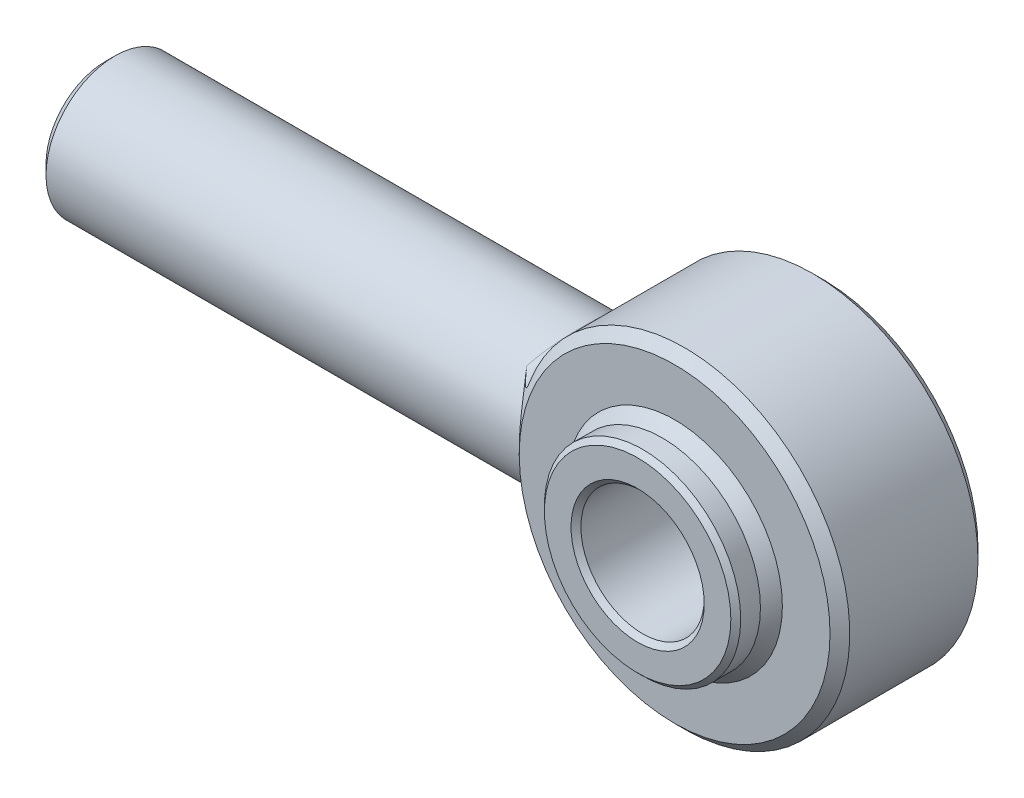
ISO-10303-21;
HEADER;
FILE_DESCRIPTION(('STEP AP214'),'2;1');
FILE_NAME('part.step','',(''),(''),'','','');
FILE_SCHEMA(('AUTOMOTIVE_DESIGN { 1 0 10303 214 1 1 1 1 }'));
ENDSEC;
DATA;
#1=APPLICATION_CONTEXT('core data for automotive mechanical design processes');
#2=APPLICATION_PROTOCOL_DEFINITION('international standard','automotive_design',2000,#1);
#3=PRODUCT_CONTEXT('',#1,'mechanical');
#4=PRODUCT('Part','Part','',(#3));
#5=PRODUCT_RELATED_PRODUCT_CATEGORY('part','',(#4));
#6=PRODUCT_DEFINITION_FORMATION('','',#4);
#7=PRODUCT_DEFINITION_CONTEXT('part definition',#1,'design');
#8=PRODUCT_DEFINITION('design','',#6,#7);
#9=PRODUCT_DEFINITION_SHAPE('','',#8);
#10=(LENGTH_UNIT() NAMED_UNIT(*) SI_UNIT(.MILLI.,.METRE.));
#11=(NAMED_UNIT(*) PLANE_ANGLE_UNIT() SI_UNIT($,.RADIAN.));
#12=(NAMED_UNIT(*) SI_UNIT($,.STERADIAN.) SOLID_ANGLE_UNIT());
#13=UNCERTAINTY_MEASURE_WITH_UNIT(LENGTH_MEASURE(1.E-05),#10,'distance_accuracy_value','');
#14=(GEOMETRIC_REPRESENTATION_CONTEXT(3) GLOBAL_UNCERTAINTY_ASSIGNED_CONTEXT((#13)) GLOBAL_UNIT_ASSIGNED_CONTEXT((#10,
#11,#12)) REPRESENTATION_CONTEXT('',''));
#15=CARTESIAN_POINT('',(0.,0.,0.));
#16=DIRECTION('',(0.,0.,1.));
#17=DIRECTION('',(1.,0.,0.));
#18=AXIS2_PLACEMENT_3D('',#15,#16,#17);
#19=CARTESIAN_POINT('',(0.,0.,0.));
#20=DIRECTION('',(-1.,0.,0.));
#21=DIRECTION('',(0.,1.,0.));
#22=AXIS2_PLACEMENT_3D('',#19,#20,#21);
#23=SPHERICAL_SURFACE('',#22,26.5);
#24=CARTESIAN_POINT('',(0.,0.,0.));
#25=DIRECTION('',(0.,0.,1.));
#26=DIRECTION('',(1.,0.,0.));
#27=AXIS2_PLACEMENT_3D('',#24,#25,#26);
#28=SPHERICAL_SURFACE('',#27,26.5);
#29=CARTESIAN_POINT('',(0.,0.,15.));
#30=DIRECTION('',(0.,0.,1.));
#31=DIRECTION('',(1.,0.,0.));
#32=AXIS2_PLACEMENT_3D('',#29,#30,#31);
#33=CIRCLE('',#32,21.8460522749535);
#34=CARTESIAN_POINT('',(21.8460522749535,0.,15.));
#35=VERTEX_POINT('',#34);
#36=EDGE_CURVE('E104',#35,#35,#33,.T.);
#37=ORIENTED_EDGE('',*,*,#36,.T.);
#38=EDGE_LOOP('',(#37));
#39=FACE_BOUND('',#38,.T.);
#40=CARTESIAN_POINT('',(0.,0.,17.5));
#41=DIRECTION('',(0.,0.,1.));
#42=DIRECTION('',(0.,-1.,0.));
#43=AXIS2_PLACEMENT_3D('',#40,#41,#42);
#44=CIRCLE('',#43,19.8997487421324);
#45=CARTESIAN_POINT('',(0.,-19.8997487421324,17.5));
#46=VERTEX_POINT('',#45);
#47=EDGE_CURVE('E117',#46,#46,#44,.T.);
#48=ORIENTED_EDGE('',*,*,#47,.F.);
#49=EDGE_LOOP('',(#48));
#50=FACE_BOUND('',#49,.T.);
#51=ADVANCED_FACE('F31',(#39,#50),#28,.T.);
#52=CARTESIAN_POINT('',(0.,0.,0.));
#53=DIRECTION('',(0.,0.,1.));
#54=DIRECTION('',(1.,0.,0.));
#55=AXIS2_PLACEMENT_3D('',#52,#53,#54);
#56=SPHERICAL_SURFACE('',#55,26.5);
#57=CARTESIAN_POINT('',(0.,0.,-15.));
#58=DIRECTION('',(0.,0.,1.));
#59=DIRECTION('',(1.,0.,0.));
#60=AXIS2_PLACEMENT_3D('',#57,#58,#59);
#61=CIRCLE('',#60,21.8460522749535);
#62=CARTESIAN_POINT('',(21.8460522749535,0.,-15.));
#63=VERTEX_POINT('',#62);
#64=EDGE_CURVE('E99',#63,#63,#61,.T.);
#65=ORIENTED_EDGE('',*,*,#64,.F.);
#66=EDGE_LOOP('',(#65));
#67=FACE_BOUND('',#66,.T.);
#68=CARTESIAN_POINT('',(0.,0.,-17.5));
#69=DIRECTION('',(0.,0.,-1.));
#70=DIRECTION('',(0.,1.,0.));
#71=AXIS2_PLACEMENT_3D('',#68,#69,#70);
#72=CIRCLE('',#71,19.8997487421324);
#73=CARTESIAN_POINT('',(0.,19.8997487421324,-17.5));
#74=VERTEX_POINT('',#73);
#75=EDGE_CURVE('E114',#74,#74,#72,.T.);
#76=ORIENTED_EDGE('',*,*,#75,.F.);
#77=EDGE_LOOP('',(#76));
#78=FACE_BOUND('',#77,.T.);
#79=ADVANCED_FACE('F216',(#67,#78),#56,.T.);
#80=CARTESIAN_POINT('',(0.,0.,15.));
#81=DIRECTION('',(0.,0.,1.));
#82=DIRECTION('',(1.,0.,0.));
#83=AXIS2_PLACEMENT_3D('',#80,#81,#82);
#84=PLANE('',#83);
#85=CARTESIAN_POINT('',(0.,0.,15.));
#86=DIRECTION('',(0.,0.,1.));
#87=DIRECTION('',(1.,0.,0.));
#88=AXIS2_PLACEMENT_3D('',#85,#86,#87);
#89=CIRCLE('',#88,31.5);
#90=CARTESIAN_POINT('',(31.5,0.,15.));
#91=VERTEX_POINT('',#90);
#92=EDGE_CURVE('E110',#91,#91,#89,.T.);
#93=ORIENTED_EDGE('',*,*,#92,.T.);
#94=EDGE_LOOP('',(#93));
#95=FACE_BOUND('',#94,.T.);
#96=ORIENTED_EDGE('',*,*,#36,.F.);
#97=EDGE_LOOP('',(#96));
#98=FACE_BOUND('',#97,.T.);
#99=ADVANCED_FACE('F210',(#95,#98),#84,.T.);
#100=CARTESIAN_POINT('',(0.,0.,-15.));
#101=DIRECTION('',(0.,0.,1.));
#102=DIRECTION('',(1.,0.,0.));
#103=AXIS2_PLACEMENT_3D('',#100,#101,#102);
#104=PLANE('',#103);
#105=CARTESIAN_POINT('',(0.,0.,-15.));
#106=DIRECTION('',(0.,0.,1.));
#107=DIRECTION('',(1.,0.,0.));
#108=AXIS2_PLACEMENT_3D('',#105,#106,#107);
#109=CIRCLE('',#108,31.5);
#110=CARTESIAN_POINT('',(31.5,0.,-15.));
#111=VERTEX_POINT('',#110);
#112=EDGE_CURVE('E101',#111,#111,#109,.F.);
#113=ORIENTED_EDGE('',*,*,#112,.T.);
#114=EDGE_LOOP('',(#113));
#115=FACE_BOUND('',#114,.T.);
#116=ORIENTED_EDGE('',*,*,#64,.T.);
#117=EDGE_LOOP('',(#116));
#118=FACE_BOUND('',#117,.T.);
#119=ADVANCED_FACE('F209',(#115,#118),#104,.F.);
#120=CARTESIAN_POINT('',(0.,0.,15.));
#121=DIRECTION('',(0.,0.,-1.));
#122=DIRECTION('',(-1.,0.,0.));
#123=AXIS2_PLACEMENT_3D('',#120,#121,#122);
#124=CYLINDRICAL_SURFACE('',#123,33.5);
#125=CARTESIAN_POINT('',(0.,0.,13.));
#126=DIRECTION('',(0.,0.,1.));
#127=DIRECTION('',(1.,0.,0.));
#128=AXIS2_PLACEMENT_3D('',#125,#126,#127);
#129=CIRCLE('',#128,33.5);
#130=CARTESIAN_POINT('',(-31.2551085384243,12.0568731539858,13.));
#131=VERTEX_POINT('',#130);
#132=CARTESIAN_POINT('',(-31.2551085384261,-12.0568731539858,13.));
#133=VERTEX_POINT('',#132);
#134=EDGE_CURVE('E89',#131,#133,#129,.F.);
#135=ORIENTED_EDGE('',*,*,#134,.T.);
#136=CARTESIAN_POINT('',(-32.5930623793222,-7.74224029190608,16.7877687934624));
#137=CARTESIAN_POINT('',(-33.0681469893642,-5.74224264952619,12.8013844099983));
#138=CARTESIAN_POINT('',(-37.4576985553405,-6.55627261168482,12.369934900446));
#139=CARTESIAN_POINT('',(-32.5024547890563,-8.12381135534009,16.5553615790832));
#140=CARTESIAN_POINT('',(-33.0187882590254,-6.05391088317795,12.6633076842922));
#141=CARTESIAN_POINT('',(-37.3535674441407,-6.87939406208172,12.1986874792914));
#142=CARTESIAN_POINT('',(-32.4068281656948,-8.49644877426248,16.3063560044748));
#143=CARTESIAN_POINT('',(-32.9645770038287,-6.36591198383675,12.511130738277));
#144=CARTESIAN_POINT('',(-37.2436681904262,-7.19495033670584,12.0152096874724));
#145=CARTESIAN_POINT('',(-32.2078157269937,-9.22212326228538,15.7770155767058));
#146=CARTESIAN_POINT('',(-32.8477143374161,-6.98420032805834,12.178918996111));
#147=CARTESIAN_POINT('',(-37.0149524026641,-7.80946494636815,11.6251693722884));
#148=CARTESIAN_POINT('',(-32.1044325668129,-9.57516696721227,15.4966914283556));
#149=CARTESIAN_POINT('',(-32.7851828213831,-7.29037692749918,11.9992652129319));
#150=CARTESIAN_POINT('',(-36.8961389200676,-8.10842890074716,11.4186147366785));
#151=CARTESIAN_POINT('',(-31.8918600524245,-10.2610255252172,14.9056946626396));
#152=CARTESIAN_POINT('',(-32.6524294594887,-7.89485547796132,11.6112066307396));
#153=CARTESIAN_POINT('',(-36.6518391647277,-8.68922664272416,10.9831434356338));
#154=CARTESIAN_POINT('',(-31.7826570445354,-10.5937884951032,14.5949491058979));
#155=CARTESIAN_POINT('',(-32.5822835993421,-8.19315069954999,11.4030735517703));
#156=CARTESIAN_POINT('',(-36.5263372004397,-8.97101649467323,10.7541730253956));
#157=CARTESIAN_POINT('',(-31.561059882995,-11.2367755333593,13.9453600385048));
#158=CARTESIAN_POINT('',(-32.4359664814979,-8.77774175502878,10.9586103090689));
#159=CARTESIAN_POINT('',(-36.2716658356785,-9.51550983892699,10.2755284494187));
#160=CARTESIAN_POINT('',(-31.4486653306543,-11.546996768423,13.6065130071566));
#161=CARTESIAN_POINT('',(-32.359858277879,-9.06415354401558,10.7225725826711));
#162=CARTESIAN_POINT('',(-36.1424959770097,-9.77821093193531,10.0258516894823));
#163=CARTESIAN_POINT('',(-31.2122620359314,-12.1723862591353,12.8683247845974));
#164=CARTESIAN_POINT('',(-32.1960446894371,-9.64834427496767,10.1990160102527));
#165=CARTESIAN_POINT('',(-35.870808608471,-10.3078023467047,9.48192352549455));
#166=CARTESIAN_POINT('',(-31.0881805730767,-12.4851354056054,12.4663020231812));
#167=CARTESIAN_POINT('',(-32.1078735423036,-9.94512640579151,9.90873100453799));
#168=CARTESIAN_POINT('',(-35.7282075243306,-10.5726441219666,9.18569622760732));
#169=CARTESIAN_POINT('',(-30.8425456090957,-13.0801761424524,11.6325588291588));
#170=CARTESIAN_POINT('',(-31.9295767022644,-10.5160114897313,9.29632680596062));
#171=CARTESIAN_POINT('',(-35.4459106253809,-11.0765356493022,8.57135913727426));
#172=CARTESIAN_POINT('',(-30.7209921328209,-13.3624674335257,11.2008381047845));
#173=CARTESIAN_POINT('',(-31.83942597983,-10.7904980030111,8.97438504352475));
#174=CARTESIAN_POINT('',(-35.3062148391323,-11.3155851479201,8.25324912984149));
#175=CARTESIAN_POINT('',(-30.4841310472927,-13.8943279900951,10.3106940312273));
#176=CARTESIAN_POINT('',(-31.6607279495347,-11.3122165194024,8.30118247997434));
#177=CARTESIAN_POINT('',(-35.0340013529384,-11.7659745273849,7.59735349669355));
#178=CARTESIAN_POINT('',(-30.3688117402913,-14.1439598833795,9.85232429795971));
#179=CARTESIAN_POINT('',(-31.5720988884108,-11.5599493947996,7.95002439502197));
#180=CARTESIAN_POINT('',(-34.901470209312,-11.9773674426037,7.25960737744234));
#181=CARTESIAN_POINT('',(-30.1477618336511,-14.6092020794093,8.91065018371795));
#182=CARTESIAN_POINT('',(-31.3999292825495,-12.02478430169,7.22042240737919));
#183=CARTESIAN_POINT('',(-34.6474277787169,-12.3713431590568,6.56574224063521));
#184=CARTESIAN_POINT('',(-30.0420273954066,-14.824826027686,8.42735590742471));
#185=CARTESIAN_POINT('',(-31.316259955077,-12.2423880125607,6.84187804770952));
#186=CARTESIAN_POINT('',(-34.5259120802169,-12.5539375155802,6.20963066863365));
#187=CARTESIAN_POINT('',(-29.8317321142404,-15.2439890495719,7.37893635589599));
#188=CARTESIAN_POINT('',(-31.1482512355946,-12.6672921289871,6.01380344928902));
#189=CARTESIAN_POINT('',(-34.2842294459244,-12.9088925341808,5.43711099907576));
#190=CARTESIAN_POINT('',(-29.72883359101,-15.4429755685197,6.8109493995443));
#191=CARTESIAN_POINT('',(-31.0647396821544,-12.8710933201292,5.56042431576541));
#192=CARTESIAN_POINT('',(-34.1659729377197,-13.0773980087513,5.01859429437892));
#193=CARTESIAN_POINT('',(-29.5442330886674,-15.793278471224,5.65124160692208));
#194=CARTESIAN_POINT('',(-30.9138384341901,-13.231003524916,4.62819360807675));
#195=CARTESIAN_POINT('',(-33.953820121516,-13.3740410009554,4.1640727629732));
#196=CARTESIAN_POINT('',(-29.4625344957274,-15.9445872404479,5.05951699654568));
#197=CARTESIAN_POINT('',(-30.8462129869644,-13.3877363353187,4.14871815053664));
#198=CARTESIAN_POINT('',(-33.8599277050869,-13.5021720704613,3.72806515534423));
#199=CARTESIAN_POINT('',(-29.3410205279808,-16.1668305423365,4.0016134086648));
#200=CARTESIAN_POINT('',(-30.7451871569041,-13.6183783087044,3.28720904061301));
#201=CARTESIAN_POINT('',(-33.7202773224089,-13.6903718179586,2.94855724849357));
#202=CARTESIAN_POINT('',(-29.2958634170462,-16.2483269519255,3.53913906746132));
#203=CARTESIAN_POINT('',(-30.7074072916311,-13.7032824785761,2.90916246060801));
#204=CARTESIAN_POINT('',(-33.6683803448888,-13.7593844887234,2.60778668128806));
#205=CARTESIAN_POINT('',(-29.2217204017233,-16.381297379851,2.60668766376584));
#206=CARTESIAN_POINT('',(-30.6452791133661,-13.8418663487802,2.14533007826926));
#207=CARTESIAN_POINT('',(-33.5831712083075,-13.8719863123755,1.92071722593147));
#208=CARTESIAN_POINT('',(-29.1927375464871,-16.4327657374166,2.13670920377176));
#209=CARTESIAN_POINT('',(-30.6208614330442,-13.8957038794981,1.75911528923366));
#210=CARTESIAN_POINT('',(-33.5498625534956,-13.9155706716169,1.57441730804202));
#211=CARTESIAN_POINT('',(-29.1519399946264,-16.5050332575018,1.19242481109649));
#212=CARTESIAN_POINT('',(-30.5864948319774,-13.9712518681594,0.982489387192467));
#213=CARTESIAN_POINT('',(-33.5029758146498,-13.9767681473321,0.878628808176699));
#214=CARTESIAN_POINT('',(-29.140134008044,-16.525816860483,0.718116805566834));
#215=CARTESIAN_POINT('',(-30.5765114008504,-13.9930384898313,0.591608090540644));
#216=CARTESIAN_POINT('',(-33.4894077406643,-13.9943680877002,0.529138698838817));
#217=CARTESIAN_POINT('',(-29.134128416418,-16.5364023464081,-0.231082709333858));
#218=CARTESIAN_POINT('',(-30.57144189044,-14.0041177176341,-0.190312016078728));
#219=CARTESIAN_POINT('',(-33.4825057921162,-14.0033320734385,-0.170271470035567));
#220=CARTESIAN_POINT('',(-29.1399279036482,-16.526205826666,-0.705974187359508));
#221=CARTESIAN_POINT('',(-30.5763487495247,-13.9934257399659,-0.581835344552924));
#222=CARTESIAN_POINT('',(-33.4891708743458,-13.9946974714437,-0.520191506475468));
#223=CARTESIAN_POINT('',(-29.1689163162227,-16.4749863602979,-1.65244601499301));
#224=CARTESIAN_POINT('',(-30.6007937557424,-13.9398485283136,-1.36089689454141));
#225=CARTESIAN_POINT('',(-33.5224859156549,-13.9513238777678,-1.21759180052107));
#226=CARTESIAN_POINT('',(-29.1920908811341,-16.4339888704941,-2.12402877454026));
#227=CARTESIAN_POINT('',(-30.6203498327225,-13.8969239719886,-1.74891378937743));
#228=CARTESIAN_POINT('',(-33.5491193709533,-13.9166064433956,-1.5650738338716));
#229=CARTESIAN_POINT('',(-29.2550167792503,-16.3217069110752,-3.06091763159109));
#230=CARTESIAN_POINT('',(-30.6731928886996,-13.7797548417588,-2.51764264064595));
#231=CARTESIAN_POINT('',(-33.6214371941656,-13.8215239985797,-2.25541299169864));
#232=CARTESIAN_POINT('',(-29.2947684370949,-16.2504218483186,-3.52622360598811));
#233=CARTESIAN_POINT('',(-30.7065425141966,-13.7053693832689,-2.89879751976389));
#234=CARTESIAN_POINT('',(-33.6671219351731,-13.7611584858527,-2.59827002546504));
#235=CARTESIAN_POINT('',(-29.3895380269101,-16.0783915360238,-4.44745713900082));
#236=CARTESIAN_POINT('',(-30.7855432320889,-13.5266120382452,-3.65044894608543));
#237=CARTESIAN_POINT('',(-33.7760362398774,-13.6154800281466,-3.2770736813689));
#238=CARTESIAN_POINT('',(-29.4445556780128,-15.9776468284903,-4.90338486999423));
#239=CARTESIAN_POINT('',(-30.8312811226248,-13.4220364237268,-4.02133643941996));
#240=CARTESIAN_POINT('',(-33.8392654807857,-13.5301675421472,-3.6130204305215));
#241=CARTESIAN_POINT('',(-29.5681749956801,-15.747699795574,-5.80333777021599));
#242=CARTESIAN_POINT('',(-30.9332378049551,-13.1845647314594,-4.74967526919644));
#243=CARTESIAN_POINT('',(-33.9813354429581,-13.3354441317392,-4.27614362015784));
#244=CARTESIAN_POINT('',(-29.6367821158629,-15.6184860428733,-6.24735807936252));
#245=CARTESIAN_POINT('',(-30.9895622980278,-13.0514030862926,-5.10744401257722));
#246=CARTESIAN_POINT('',(-34.0601824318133,-13.2260235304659,-4.60331647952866));
#247=CARTESIAN_POINT('',(-29.7869820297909,-15.3301207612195,-7.12917168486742));
#248=CARTESIAN_POINT('',(-31.1117073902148,-12.7560108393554,-5.81348188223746));
#249=CARTESIAN_POINT('',(-34.2328002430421,-12.9818304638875,-5.25307387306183));
#250=CARTESIAN_POINT('',(-29.8687939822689,-15.1704538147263,-7.56669256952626));
#251=CARTESIAN_POINT('',(-31.1777897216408,-12.5929959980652,-6.16166810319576));
#252=CARTESIAN_POINT('',(-34.3268229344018,-12.8466215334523,-5.57545768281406));
#253=CARTESIAN_POINT('',(-30.042216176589,-14.8240600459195,-8.42483629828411));
#254=CARTESIAN_POINT('',(-31.316266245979,-12.2418963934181,-6.83925104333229));
#255=CARTESIAN_POINT('',(-34.5261290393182,-12.5532888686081,-6.2077741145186));
#256=CARTESIAN_POINT('',(-30.1338296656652,-14.6373242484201,-8.84545347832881));
#257=CARTESIAN_POINT('',(-31.3887658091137,-12.0534805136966,-7.16881294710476));
#258=CARTESIAN_POINT('',(-34.6314161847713,-12.3951575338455,-6.51770256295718));
#259=CARTESIAN_POINT('',(-30.3245379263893,-14.2380248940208,-9.66802689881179));
#260=CARTESIAN_POINT('',(-31.5376767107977,-11.6539532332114,-7.8073523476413));
#261=CARTESIAN_POINT('',(-34.8505883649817,-12.0570234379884,-7.12380929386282));
#262=CARTESIAN_POINT('',(-30.4236354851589,-14.0254516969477,-10.069976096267));
#263=CARTESIAN_POINT('',(-31.6141751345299,-11.4425105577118,-8.11640433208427));
#264=CARTESIAN_POINT('',(-34.964476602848,-11.8770125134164,-7.41998238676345));
#265=CARTESIAN_POINT('',(-30.6269485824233,-13.5757472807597,-10.8535049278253));
#266=CARTESIAN_POINT('',(-31.7687189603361,-10.9994728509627,-8.71235163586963));
#267=CARTESIAN_POINT('',(-35.1981349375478,-11.4961944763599,-7.99731942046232));
#268=CARTESIAN_POINT('',(-30.7311644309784,-13.3386145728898,-11.2350833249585));
#269=CARTESIAN_POINT('',(-31.8468247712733,-10.7675714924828,-8.9992416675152));
#270=CARTESIAN_POINT('',(-35.3179053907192,-11.2953861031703,-8.27848244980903));
#271=CARTESIAN_POINT('',(-30.9555033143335,-12.8101164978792,-12.0223691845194));
#272=CARTESIAN_POINT('',(-32.0121032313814,-10.256061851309,-9.58412936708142));
#273=CARTESIAN_POINT('',(-35.5757276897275,-10.8478441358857,-8.85858782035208));
#274=CARTESIAN_POINT('',(-31.0759979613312,-12.5156717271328,-12.4252124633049));
#275=CARTESIAN_POINT('',(-32.099137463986,-9.97405862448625,-9.8786225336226));
#276=CARTESIAN_POINT('',(-35.7142066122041,-10.5985028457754,-9.15541971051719));
#277=CARTESIAN_POINT('',(-31.3173348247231,-11.8989145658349,-13.2012879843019));
#278=CARTESIAN_POINT('',(-32.2695116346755,-9.39166930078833,-10.4368618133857));
#279=CARTESIAN_POINT('',(-35.9915639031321,-10.0762214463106,-9.72726482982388));
#280=CARTESIAN_POINT('',(-31.4381769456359,-11.5766092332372,-13.5745276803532));
#281=CARTESIAN_POINT('',(-32.3528416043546,-9.0909894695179,-10.7003781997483));
#282=CARTESIAN_POINT('',(-36.1304421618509,-9.80328731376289,-10.002283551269));
#283=CARTESIAN_POINT('',(-31.6771283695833,-10.9057891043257,-14.2894056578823));
#284=CARTESIAN_POINT('',(-32.5133902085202,-8.47508073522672,-11.1959040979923));
#285=CARTESIAN_POINT('',(-36.4050579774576,-9.23522439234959,-10.5290357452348));
#286=CARTESIAN_POINT('',(-31.795238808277,-10.5572854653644,-14.631057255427));
#287=CARTESIAN_POINT('',(-32.5905489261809,-8.15967220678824,-11.4275924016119));
#288=CARTESIAN_POINT('',(-36.5407968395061,-8.94010505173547,-10.7807790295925));
#289=CARTESIAN_POINT('',(-32.0258335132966,-9.83562329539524,-15.2808891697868));
#290=CARTESIAN_POINT('',(-32.7368747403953,-7.51797405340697,-11.85932324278));
#291=CARTESIAN_POINT('',(-36.805808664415,-8.32898814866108,-11.2596025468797));
#292=CARTESIAN_POINT('',(-32.1383175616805,-9.4624638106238,-15.5890681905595));
#293=CARTESIAN_POINT('',(-32.8059336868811,-7.19163735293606,-12.058955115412));
#294=CARTESIAN_POINT('',(-36.9350813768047,-8.01298977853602,-11.4866818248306));
#295=CARTESIAN_POINT('',(-32.3595772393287,-8.67649609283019,-16.1825176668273));
#296=CARTESIAN_POINT('',(-32.9375428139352,-6.51716459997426,-12.4349803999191));
#297=CARTESIAN_POINT('',(-37.1893648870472,-7.34741774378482,-11.9239603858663));
#298=CARTESIAN_POINT('',(-32.4679748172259,-8.26266721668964,-16.4661941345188));
#299=CARTESIAN_POINT('',(-32.9994861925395,-6.16898911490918,-12.609375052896));
#300=CARTESIAN_POINT('',(-37.3139412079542,-6.99697977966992,-12.1329851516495));
#301=CARTESIAN_POINT('',(-32.6725061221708,-7.41271931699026,-16.9921367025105));
#302=CARTESIAN_POINT('',(-33.1123144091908,-5.4687384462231,-12.9249305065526));
#303=CARTESIAN_POINT('',(-37.5489995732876,-6.27722814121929,-12.5205217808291));
#304=CARTESIAN_POINT('',(-32.7686414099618,-6.97660314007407,-17.2344080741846));
#305=CARTESIAN_POINT('',(-33.1630218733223,-5.11697983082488,-13.065570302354));
#306=CARTESIAN_POINT('',(-37.6594834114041,-5.90791687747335,-12.6990375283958));
#307=CARTESIAN_POINT('',(-32.9462350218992,-6.08306826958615,-17.6759577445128));
#308=CARTESIAN_POINT('',(-33.2534293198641,-4.41121512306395,-13.3158038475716));
#309=CARTESIAN_POINT('',(-37.863583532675,-5.15125498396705,-13.02438991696));
#310=CARTESIAN_POINT('',(-33.0276338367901,-5.62557219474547,-17.8750623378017));
#311=CARTESIAN_POINT('',(-33.2929060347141,-4.05772518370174,-13.4247715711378));
#312=CARTESIAN_POINT('',(-37.9571314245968,-4.76383882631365,-13.1710985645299));
#313=CARTESIAN_POINT('',(-33.1365063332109,-4.92723336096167,-18.1387424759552));
#314=CARTESIAN_POINT('',(-33.3438936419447,-3.52957412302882,-13.5656819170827));
#315=CARTESIAN_POINT('',(-38.0822535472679,-4.17247255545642,-13.3653891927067));
#316=CARTESIAN_POINT('',(-33.1706060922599,-4.6923220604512,-18.2208374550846));
#317=CARTESIAN_POINT('',(-33.3595471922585,-3.35336681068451,-13.6089755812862));
#318=CARTESIAN_POINT('',(-38.1214428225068,-3.9735453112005,-13.425880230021));
#319=CARTESIAN_POINT('',(-33.2341327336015,-4.21894392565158,-18.3730917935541));
#320=CARTESIAN_POINT('',(-33.3882217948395,-3.00146188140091,-13.6883656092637));
#321=CARTESIAN_POINT('',(-38.1944510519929,-3.57267993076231,-13.5380676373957));
#322=CARTESIAN_POINT('',(-33.2635591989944,-3.98047677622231,-18.4432500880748));
#323=CARTESIAN_POINT('',(-33.4012255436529,-2.82585643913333,-13.7244144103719));
#324=CARTESIAN_POINT('',(-38.2282695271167,-3.37074152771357,-13.5897632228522));
#325=CARTESIAN_POINT('',(-33.290523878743,-3.74045717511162,-18.5073197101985));
#326=CARTESIAN_POINT('',(-33.4129510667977,-2.65084030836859,-13.7569753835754));
#327=CARTESIAN_POINT('',(-38.2592587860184,-3.16748847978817,-13.6369724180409));
#328=(BOUNDED_SURFACE() B_SPLINE_SURFACE(3,2,((#136,#137,#138),(#139,#140,#141),(#142,#143,
#144),(#145,#146,#147),(#148,#149,#150),(#151,#152,#153),(#154,#155,#156),(#157,#158,#159),
(#160,#161,#162),(#163,#164,#165),(#166,#167,#168),(#169,#170,#171),(#172,#173,#174),(#175,#176,
#177),(#178,#179,#180),(#181,#182,#183),(#184,#185,#186),(#187,#188,#189),(#190,#191,#192),
(#193,#194,#195),(#196,#197,#198),(#199,#200,#201),(#202,#203,#204),(#205,#206,#207),(#208,#209,
#210),(#211,#212,#213),(#214,#215,#216),(#217,#218,#219),(#220,#221,#222),(#223,#224,#225),
(#226,#227,#228),(#229,#230,#231),(#232,#233,#234),(#235,#236,#237),(#238,#239,#240),(#241,#242,
#243),(#244,#245,#246),(#247,#248,#249),(#250,#251,#252),(#253,#254,#255),(#256,#257,#258),
(#259,#260,#261),(#262,#263,#264),(#265,#266,#267),(#268,#269,#270),(#271,#272,#273),(#274,#275,
#276),(#277,#278,#279),(#280,#281,#282),(#283,#284,#285),(#286,#287,#288),(#289,#290,#291),
(#292,#293,#294),(#295,#296,#297),(#298,#299,#300),(#301,#302,#303),(#304,#305,#306),(#307,#308,
#309),(#310,#311,#312),(#313,#314,#315),(#316,#317,#318),(#319,#320,#321),(#322,#323,#324),
(#325,#326,#327)),.UNSPECIFIED.,.F.,.F.,.F.) B_SPLINE_SURFACE_WITH_KNOTS((4,2,2,2,2,2,2,2,2,2,2,
2,2,2,2,2,2,2,2,2,2,2,2,2,2,2,2,2,2,2,2,4),(3,3),(0.,1.52079058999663,3.04106294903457,
4.56507405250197,6.08927638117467,7.76077605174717,9.43229214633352,11.1005544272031,
12.7681456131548,14.635779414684,16.5037113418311,17.9262769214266,19.3491105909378,
20.7726654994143,22.1961470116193,23.6184533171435,25.0407874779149,26.4630954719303,
27.8859754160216,29.3355066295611,30.7855195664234,32.2360751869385,33.6867187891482,
35.3170164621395,36.9469023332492,38.5760979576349,40.2053566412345,41.9059562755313,
43.6063392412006,45.3134426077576,46.1678165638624,47.0222666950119),(0.,1.),
.UNSPECIFIED.) GEOMETRIC_REPRESENTATION_ITEM() RATIONAL_B_SPLINE_SURFACE(((1.,0.744389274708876,
1.),(1.,0.747972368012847,1.),(1.,0.751710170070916,1.),(1.,0.759391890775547,1.),(1.,
0.763335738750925,1.),(1.,0.7713386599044,1.),(1.,0.77539799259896,1.),(1.,0.783526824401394,
1.),(1.,0.787596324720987,1.),(1.,0.796044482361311,1.),(1.,0.800415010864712,1.),(1.,
0.80894859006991,1.),(1.,0.813111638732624,1.),(1.,0.821120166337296,1.),(1.,0.824966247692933,
1.),(1.,0.832253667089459,1.),(1.,0.835695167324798,1.),(1.,0.842471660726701,1.),(1.,
0.845744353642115,1.),(1.,0.851564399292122,1.),(1.,0.854111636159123,1.),(1.,0.857877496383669,
1.),(1.,0.859268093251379,1.),(1.,0.861544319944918,1.),(1.,0.862429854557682,1.),(1.,
0.863674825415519,1.),(1.,0.864033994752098,1.),(1.,0.864216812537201,1.),(1.,0.864040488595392,
1.),(1.,0.863156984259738,1.),(1.,0.86245024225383,1.),(1.,0.86052313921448,1.),(1.,
0.859302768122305,1.),(1.,0.856376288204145,1.),(1.,0.854670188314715,1.),(1.,0.850808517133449,
1.),(1.,0.8486527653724,1.),(1.,0.843892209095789,1.),(1.,0.841279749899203,1.),(1.,
0.835686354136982,1.),(1.,0.832705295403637,1.),(1.,0.826431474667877,1.),(1.,0.823138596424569,
1.),(1.,0.816303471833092,1.),(1.,0.812761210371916,1.),(1.,0.805042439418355,1.),(1.,
0.800841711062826,1.),(1.,0.79230888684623,1.),(1.,0.787976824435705,1.),(1.,0.77928941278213,
1.),(1.,0.774934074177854,1.),(1.,0.76631366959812,1.),(1.,0.762048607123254,1.),(1.,
0.75354961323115,1.),(1.,0.749325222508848,1.),(1.,0.741255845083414,1.),(1.,0.737410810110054,
1.),(1.,0.730232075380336,1.),(1.,0.726900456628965,1.),(1.,0.722406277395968,1.),(1.,
0.720991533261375,1.),(1.,0.718345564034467,1.),(1.,0.717114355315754,1.),(1.,0.715982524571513,1.))) REPRESENTATION_ITEM('') SURFACE());
#329=CARTESIAN_POINT('',(-32.5930623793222,-7.74224029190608,16.7877687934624));
#330=CARTESIAN_POINT('',(-32.5024547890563,-8.12381135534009,16.5553615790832));
#331=CARTESIAN_POINT('',(-32.4068281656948,-8.49644877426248,16.3063560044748));
#332=CARTESIAN_POINT('',(-32.2078157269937,-9.22212326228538,15.7770155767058));
#333=CARTESIAN_POINT('',(-32.1044325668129,-9.57516696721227,15.4966914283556));
#334=CARTESIAN_POINT('',(-31.8918600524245,-10.2610255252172,14.9056946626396));
#335=CARTESIAN_POINT('',(-31.7826570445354,-10.5937884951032,14.5949491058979));
#336=CARTESIAN_POINT('',(-31.561059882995,-11.2367755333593,13.9453600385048));
#337=CARTESIAN_POINT('',(-31.4486653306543,-11.546996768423,13.6065130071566));
#338=CARTESIAN_POINT('',(-31.2122620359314,-12.1723862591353,12.8683247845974));
#339=CARTESIAN_POINT('',(-31.0881805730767,-12.4851354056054,12.4663020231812));
#340=CARTESIAN_POINT('',(-30.8425456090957,-13.0801761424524,11.6325588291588));
#341=CARTESIAN_POINT('',(-30.7209921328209,-13.3624674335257,11.2008381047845));
#342=CARTESIAN_POINT('',(-30.4841310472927,-13.8943279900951,10.3106940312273));
#343=CARTESIAN_POINT('',(-30.3688117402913,-14.1439598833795,9.85232429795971));
#344=CARTESIAN_POINT('',(-30.1477618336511,-14.6092020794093,8.91065018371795));
#345=CARTESIAN_POINT('',(-30.0420273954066,-14.824826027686,8.42735590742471));
#346=CARTESIAN_POINT('',(-29.8317321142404,-15.2439890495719,7.37893635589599));
#347=CARTESIAN_POINT('',(-29.72883359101,-15.4429755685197,6.8109493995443));
#348=CARTESIAN_POINT('',(-29.5442330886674,-15.793278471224,5.65124160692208));
#349=CARTESIAN_POINT('',(-29.4625344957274,-15.9445872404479,5.05951699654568));
#350=CARTESIAN_POINT('',(-29.3410205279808,-16.1668305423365,4.0016134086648));
#351=CARTESIAN_POINT('',(-29.2958634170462,-16.2483269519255,3.53913906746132));
#352=CARTESIAN_POINT('',(-29.2217204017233,-16.381297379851,2.60668766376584));
#353=CARTESIAN_POINT('',(-29.1927375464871,-16.4327657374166,2.13670920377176));
#354=CARTESIAN_POINT('',(-29.1519399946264,-16.5050332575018,1.19242481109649));
#355=CARTESIAN_POINT('',(-29.140134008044,-16.525816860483,0.718116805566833));
#356=CARTESIAN_POINT('',(-29.134128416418,-16.5364023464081,-0.231082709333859));
#357=CARTESIAN_POINT('',(-29.1399279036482,-16.526205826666,-0.705974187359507));
#358=CARTESIAN_POINT('',(-29.1689163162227,-16.4749863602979,-1.65244601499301));
#359=CARTESIAN_POINT('',(-29.1920908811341,-16.4339888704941,-2.12402877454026));
#360=CARTESIAN_POINT('',(-29.2550167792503,-16.3217069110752,-3.06091763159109));
#361=CARTESIAN_POINT('',(-29.2947684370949,-16.2504218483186,-3.52622360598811));
#362=CARTESIAN_POINT('',(-29.3895380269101,-16.0783915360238,-4.44745713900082));
#363=CARTESIAN_POINT('',(-29.4445556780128,-15.9776468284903,-4.90338486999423));
#364=CARTESIAN_POINT('',(-29.5681749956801,-15.747699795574,-5.80333777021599));
#365=CARTESIAN_POINT('',(-29.6367821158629,-15.6184860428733,-6.24735807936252));
#366=CARTESIAN_POINT('',(-29.7869820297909,-15.3301207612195,-7.12917168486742));
#367=CARTESIAN_POINT('',(-29.8687939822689,-15.1704538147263,-7.56669256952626));
#368=CARTESIAN_POINT('',(-30.042216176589,-14.8240600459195,-8.42483629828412));
#369=CARTESIAN_POINT('',(-30.1338296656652,-14.6373242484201,-8.84545347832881));
#370=CARTESIAN_POINT('',(-30.3245379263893,-14.2380248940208,-9.66802689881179));
#371=CARTESIAN_POINT('',(-30.4236354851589,-14.0254516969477,-10.069976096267));
#372=CARTESIAN_POINT('',(-30.6269485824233,-13.5757472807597,-10.8535049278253));
#373=CARTESIAN_POINT('',(-30.7311644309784,-13.3386145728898,-11.2350833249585));
#374=CARTESIAN_POINT('',(-30.9555033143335,-12.8101164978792,-12.0223691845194));
#375=CARTESIAN_POINT('',(-31.0759979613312,-12.5156717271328,-12.4252124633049));
#376=CARTESIAN_POINT('',(-31.3173348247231,-11.8989145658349,-13.2012879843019));
#377=CARTESIAN_POINT('',(-31.4381769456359,-11.5766092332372,-13.5745276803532));
#378=CARTESIAN_POINT('',(-31.6771283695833,-10.9057891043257,-14.2894056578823));
#379=CARTESIAN_POINT('',(-31.795238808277,-10.5572854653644,-14.631057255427));
#380=CARTESIAN_POINT('',(-32.0258335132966,-9.83562329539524,-15.2808891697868));
#381=CARTESIAN_POINT('',(-32.1383175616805,-9.4624638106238,-15.5890681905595));
#382=CARTESIAN_POINT('',(-32.3595772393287,-8.67649609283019,-16.1825176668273));
#383=CARTESIAN_POINT('',(-32.4679748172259,-8.26266721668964,-16.4661941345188));
#384=CARTESIAN_POINT('',(-32.6725061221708,-7.41271931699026,-16.9921367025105));
#385=CARTESIAN_POINT('',(-32.7686414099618,-6.97660314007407,-17.2344080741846));
#386=CARTESIAN_POINT('',(-32.9462350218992,-6.08306826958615,-17.6759577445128));
#387=CARTESIAN_POINT('',(-33.0276338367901,-5.62557219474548,-17.8750623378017));
#388=CARTESIAN_POINT('',(-33.1365063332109,-4.92723336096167,-18.1387424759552));
#389=CARTESIAN_POINT('',(-33.1706060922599,-4.6923220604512,-18.2208374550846));
#390=CARTESIAN_POINT('',(-33.2341327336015,-4.21894392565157,-18.3730917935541));
#391=CARTESIAN_POINT('',(-33.2635591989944,-3.98047677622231,-18.4432500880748));
#392=CARTESIAN_POINT('',(-33.290523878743,-3.74045717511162,-18.5073197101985));
#393=B_SPLINE_CURVE_WITH_KNOTS('',3,(#329,#330,#331,#332,#333,#334,#335,#336,#337,#338,#339,
#340,#341,#342,#343,#344,#345,#346,#347,#348,#349,#350,#351,#352,#353,#354,#355,#356,#357,#358,
#359,#360,#361,#362,#363,#364,#365,#366,#367,#368,#369,#370,#371,#372,#373,#374,#375,#376,#377,
#378,#379,#380,#381,#382,#383,#384,#385,#386,#387,#388,#389,#390,#391,#392),.UNSPECIFIED.,.F.,
.F.,(4,2,2,2,2,2,2,2,2,2,2,2,2,2,2,2,2,2,2,2,2,2,2,2,2,2,2,2,2,2,2,4),(0.,1.52079058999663,
3.04106294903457,4.56507405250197,6.08927638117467,7.76077605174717,9.43229214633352,
11.1005544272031,12.7681456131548,14.635779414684,16.5037113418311,17.9262769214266,
19.3491105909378,20.7726654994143,22.1961470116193,23.6184533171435,25.0407874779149,
26.4630954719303,27.8859754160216,29.3355066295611,30.7855195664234,32.2360751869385,
33.6867187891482,35.3170164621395,36.9469023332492,38.5760979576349,40.2053566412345,
41.9059562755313,43.6063392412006,45.3134426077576,46.1678165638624,47.0222666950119),.UNSPECIFIED.);
#394=CARTESIAN_POINT('',(-31.2551085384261,-12.0568731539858,-13.));
#395=VERTEX_POINT('',#394);
#396=EDGE_CURVE('E93',#133,#395,#393,.T.);
#397=ORIENTED_EDGE('',*,*,#396,.T.);
#398=CARTESIAN_POINT('',(0.,0.,-13.));
#399=DIRECTION('',(0.,0.,1.));
#400=DIRECTION('',(1.,0.,0.));
#401=AXIS2_PLACEMENT_3D('',#398,#399,#400);
#402=CIRCLE('',#401,33.5);
#403=CARTESIAN_POINT('',(-31.2551085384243,12.0568731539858,-13.));
#404=VERTEX_POINT('',#403);
#405=EDGE_CURVE('E92',#395,#404,#402,.T.);
#406=ORIENTED_EDGE('',*,*,#405,.T.);
#407=CARTESIAN_POINT('',(-33.0844756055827,5.25998801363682,-18.0126966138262));
#408=CARTESIAN_POINT('',(-33.3194201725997,3.78222460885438,-13.4980468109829));
#409=CARTESIAN_POINT('',(-38.0224570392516,4.45425536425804,-13.2725132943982));
#410=CARTESIAN_POINT('',(-33.0211941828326,5.65827343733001,-17.8591154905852));
#411=CARTESIAN_POINT('',(-33.2896962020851,4.08359073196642,-13.4157896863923));
#412=CARTESIAN_POINT('',(-37.9497306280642,4.7915308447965,-13.1593482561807));
#413=CARTESIAN_POINT('',(-32.9514324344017,6.05043506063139,-17.6884194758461));
#414=CARTESIAN_POINT('',(-33.255769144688,4.3868674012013,-13.3222049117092));
#415=CARTESIAN_POINT('',(-37.8695566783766,5.12362057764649,-13.0335722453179));
#416=CARTESIAN_POINT('',(-32.8006960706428,6.82036902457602,-17.3144671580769));
#417=CARTESIAN_POINT('',(-33.1794643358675,4.99330691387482,-13.1111454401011));
#418=CARTESIAN_POINT('',(-37.6963223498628,5.77561493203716,-12.7580284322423));
#419=CARTESIAN_POINT('',(-32.719727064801,7.19814844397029,-17.1112271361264));
#420=CARTESIAN_POINT('',(-33.1372016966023,5.29614316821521,-12.9939936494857));
#421=CARTESIAN_POINT('',(-37.6032684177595,6.09552554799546,-12.6082726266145));
#422=CARTESIAN_POINT('',(-32.5484735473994,7.93664554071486,-16.6742513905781));
#423=CARTESIAN_POINT('',(-33.0442862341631,5.89921004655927,-12.7349076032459));
#424=CARTESIAN_POINT('',(-37.4064546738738,6.7208985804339,-12.2862904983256));
#425=CARTESIAN_POINT('',(-32.4582130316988,8.29740382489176,-16.4405938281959));
#426=CARTESIAN_POINT('',(-32.993770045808,6.19921187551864,-12.5933703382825));
#427=CARTESIAN_POINT('',(-37.302722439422,7.02639538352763,-12.1141217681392));
#428=CARTESIAN_POINT('',(-32.2701186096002,9.00124013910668,-15.9440396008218));
#429=CARTESIAN_POINT('',(-32.8847665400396,6.79466928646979,-12.2846580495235));
#430=CARTESIAN_POINT('',(-37.0865542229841,7.62241702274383,-11.7482397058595));
#431=CARTESIAN_POINT('',(-32.172283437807,9.34431519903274,-15.6811380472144));
#432=CARTESIAN_POINT('',(-32.8263840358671,7.09000557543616,-12.1178087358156));
#433=CARTESIAN_POINT('',(-36.9741167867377,7.91293934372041,-11.5545227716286));
#434=CARTESIAN_POINT('',(-31.8526565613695,10.4034232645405,-14.8022576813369));
#435=CARTESIAN_POINT('',(-32.6305384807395,8.01118009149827,-11.5497062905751));
#436=CARTESIAN_POINT('',(-36.6067844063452,8.80981168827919,-10.9069267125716));
#437=CARTESIAN_POINT('',(-31.6202268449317,11.084280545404,-14.134224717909));
#438=CARTESIAN_POINT('',(-32.4789184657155,8.62938949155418,-11.0984194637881));
#439=CARTESIAN_POINT('',(-36.339663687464,9.38637425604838,-10.4146918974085));
#440=CARTESIAN_POINT('',(-31.1501483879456,12.3439075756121,-12.6808458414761));
#441=CARTESIAN_POINT('',(-32.1552126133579,9.80203899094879,-10.0722030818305));
#442=CARTESIAN_POINT('',(-35.7994242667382,10.4530497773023,-9.34378114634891));
#443=CARTESIAN_POINT('',(-30.9124906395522,12.9224825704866,-11.8952812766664));
#444=CARTESIAN_POINT('',(-31.9833831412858,10.3581844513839,-9.4992086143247));
#445=CARTESIAN_POINT('',(-35.5262952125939,10.9429978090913,-8.76494409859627));
#446=CARTESIAN_POINT('',(-30.5618272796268,13.722910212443,-10.6102602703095));
#447=CARTESIAN_POINT('',(-31.7199085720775,11.1430684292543,-8.52926929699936));
#448=CARTESIAN_POINT('',(-35.1232940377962,11.6208147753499,-7.81808651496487));
#449=CARTESIAN_POINT('',(-30.4420096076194,13.9859803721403,-10.1465302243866));
#450=CARTESIAN_POINT('',(-31.6284524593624,11.4031023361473,-8.17588777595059));
#451=CARTESIAN_POINT('',(-34.9855931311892,11.8435874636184,-7.47639069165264));
#452=CARTESIAN_POINT('',(-30.2115813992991,14.4770113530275,-9.19196585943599));
#453=CARTESIAN_POINT('',(-31.4500414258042,11.8920081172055,-7.43964345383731));
#454=CARTESIAN_POINT('',(-34.720772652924,12.259401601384,-6.77302747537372));
#455=CARTESIAN_POINT('',(-30.1009725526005,14.7049657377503,-8.70112659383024));
#456=CARTESIAN_POINT('',(-31.3629596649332,12.1213965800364,-7.05668860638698));
#457=CARTESIAN_POINT('',(-34.5936550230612,12.4524376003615,-6.41135643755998));
#458=CARTESIAN_POINT('',(-29.8931252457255,15.1230115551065,-7.69666240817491));
#459=CARTESIAN_POINT('',(-31.197535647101,12.5443295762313,-6.26552828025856));
#460=CARTESIAN_POINT('',(-34.3547857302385,12.8064465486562,-5.67122493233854));
#461=CARTESIAN_POINT('',(-29.7958523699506,15.3132010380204,-7.18310084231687));
#462=CARTESIAN_POINT('',(-31.1190076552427,12.7384914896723,-5.8571423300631));
#463=CARTESIAN_POINT('',(-34.2429945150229,12.9675025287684,-5.2928111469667));
#464=CARTESIAN_POINT('',(-29.618073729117,15.6542881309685,-6.13558203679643));
#465=CARTESIAN_POINT('',(-30.9743985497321,13.087933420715,-5.01827102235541));
#466=CARTESIAN_POINT('',(-34.0386817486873,13.2563414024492,-4.52095518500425));
#467=CARTESIAN_POINT('',(-29.5375580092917,15.8052090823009,-5.60163713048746));
#468=CARTESIAN_POINT('',(-30.9081295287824,13.24373091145,-4.58737471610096));
#469=CARTESIAN_POINT('',(-33.9461487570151,13.3841440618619,-4.12752209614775));
#470=CARTESIAN_POINT('',(-29.4046479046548,16.0509779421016,-4.57924605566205));
#471=CARTESIAN_POINT('',(-30.7981921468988,13.4980011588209,-3.7580634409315));
#472=CARTESIAN_POINT('',(-33.7934013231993,13.5922656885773,-3.37418130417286));
#473=CARTESIAN_POINT('',(-29.3500909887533,16.1502636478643,-4.09257635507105));
#474=CARTESIAN_POINT('',(-30.7527076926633,13.6012381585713,-3.36135057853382));
#475=CARTESIAN_POINT('',(-33.7307015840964,13.6763426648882,-3.01558257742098));
#476=CARTESIAN_POINT('',(-29.2586295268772,16.3153778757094,-3.10949990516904));
#477=CARTESIAN_POINT('',(-30.6762837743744,13.7730432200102,-2.55778392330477));
#478=CARTESIAN_POINT('',(-33.6255891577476,13.8161644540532,-2.29121045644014));
#479=CARTESIAN_POINT('',(-29.2217279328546,16.381200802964,-2.61309154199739));
#480=CARTESIAN_POINT('',(-30.645249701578,13.8418300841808,-2.15044145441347));
#481=CARTESIAN_POINT('',(-33.5831798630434,13.8719045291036,-1.92543587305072));
#482=CARTESIAN_POINT('',(-29.168156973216,16.476391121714,-1.63587417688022));
#483=CARTESIAN_POINT('',(-30.6001805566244,13.9412704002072,-1.3475076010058));
#484=CARTESIAN_POINT('',(-33.5216132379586,13.9525134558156,-1.20538097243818));
#485=CARTESIAN_POINT('',(-29.1506884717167,16.5071996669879,-1.15530811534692));
#486=CARTESIAN_POINT('',(-30.5854198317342,13.9735523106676,-0.951702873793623));
#487=CARTESIAN_POINT('',(-33.5015374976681,13.9786027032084,-0.851279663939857));
#488=CARTESIAN_POINT('',(-29.1338293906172,16.5369371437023,-0.192288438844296));
#489=CARTESIAN_POINT('',(-30.571192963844,14.0046713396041,-0.158582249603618));
#490=CARTESIAN_POINT('',(-33.4821621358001,14.0037849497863,-0.141686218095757));
#491=CARTESIAN_POINT('',(-29.134444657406,16.5358557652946,0.290165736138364));
#492=CARTESIAN_POINT('',(-30.5717136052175,14.0035373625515,0.239238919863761));
#493=CARTESIAN_POINT('',(-33.4828692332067,14.0028692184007,0.213806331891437));
#494=CARTESIAN_POINT('',(-29.1537580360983,16.5017807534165,1.25364796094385));
#495=CARTESIAN_POINT('',(-30.588009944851,13.9678811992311,1.03267435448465));
#496=CARTESIAN_POINT('',(-33.5050652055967,13.9740138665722,0.923740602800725));
#497=CARTESIAN_POINT('',(-29.172476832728,16.4687506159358,1.73467374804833));
#498=CARTESIAN_POINT('',(-30.6038239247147,13.9332752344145,1.42879067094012));
#499=CARTESIAN_POINT('',(-33.5265778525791,13.946043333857,1.27818065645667));
#500=CARTESIAN_POINT('',(-29.2273541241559,16.3711602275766,2.69110022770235));
#501=CARTESIAN_POINT('',(-30.6499741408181,13.8313529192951,2.21440912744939));
#502=CARTESIAN_POINT('',(-33.5896457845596,13.8634019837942,1.98291595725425));
#503=CARTESIAN_POINT('',(-29.26351139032,16.3066021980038,3.16650131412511));
#504=CARTESIAN_POINT('',(-30.6803665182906,13.7639113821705,2.60438985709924));
#505=CARTESIAN_POINT('',(-33.6311996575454,13.8087330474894,2.33321149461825));
#506=CARTESIAN_POINT('',(-29.3518595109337,16.1470307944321,4.10670766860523));
#507=CARTESIAN_POINT('',(-30.7541730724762,13.59789412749,3.37278368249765));
#508=CARTESIAN_POINT('',(-33.7327340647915,13.6736050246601,3.02599512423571));
#509=CARTESIAN_POINT('',(-29.4039931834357,16.0521259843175,4.57154447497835));
#510=CARTESIAN_POINT('',(-30.7976264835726,13.4992308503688,3.75166051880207));
#511=CARTESIAN_POINT('',(-33.7926488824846,13.5932378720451,3.36850645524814));
#512=CARTESIAN_POINT('',(-29.5226460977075,15.8328419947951,5.48943174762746));
#513=CARTESIAN_POINT('',(-30.8957669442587,13.2723978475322,4.49613193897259));
#514=CARTESIAN_POINT('',(-33.9290111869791,13.4075441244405,4.04484444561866));
#515=CARTESIAN_POINT('',(-29.5891656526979,15.708462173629,5.94248195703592));
#516=CARTESIAN_POINT('',(-30.9505574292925,13.1439735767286,4.86208086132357));
#517=CARTESIAN_POINT('',(-34.0054590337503,13.302216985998,4.37867091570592));
#518=CARTESIAN_POINT('',(-29.7345928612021,15.4314105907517,6.83431791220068));
#519=CARTESIAN_POINT('',(-31.069227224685,12.8596123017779,5.57800537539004));
#520=CARTESIAN_POINT('',(-34.1725917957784,13.0676045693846,5.03581319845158));
#521=CARTESIAN_POINT('',(-29.8135010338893,15.2787376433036,7.27310305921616));
#522=CARTESIAN_POINT('',(-31.1332164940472,12.7033803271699,5.92825556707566));
#523=CARTESIAN_POINT('',(-34.2632773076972,12.9383182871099,5.35912856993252));
#524=CARTESIAN_POINT('',(-29.9815112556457,14.9463596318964,8.13433209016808));
#525=CARTESIAN_POINT('',(-31.2679793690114,12.3656149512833,6.61061262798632));
#526=CARTESIAN_POINT('',(-34.4563636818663,12.6568544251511,5.99371838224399));
#527=CARTESIAN_POINT('',(-30.0706171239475,14.7666444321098,8.55676977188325));
#528=CARTESIAN_POINT('',(-31.3388596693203,12.1837573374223,6.94290040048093));
#529=CARTESIAN_POINT('',(-34.5587689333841,12.5046682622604,6.30498825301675));
#530=CARTESIAN_POINT('',(-30.3603273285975,14.1670306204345,9.84341705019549));
#531=CARTESIAN_POINT('',(-31.5672278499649,11.5794039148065,7.94991042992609));
#532=CARTESIAN_POINT('',(-34.8917194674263,11.9969041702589,7.25304414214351));
#533=CARTESIAN_POINT('',(-30.5747415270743,13.7022611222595,10.6765538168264));
#534=CARTESIAN_POINT('',(-31.7320545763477,11.1170851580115,8.58660616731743));
#535=CARTESIAN_POINT('',(-35.1381357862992,11.6033287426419,7.86693439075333));
#536=CARTESIAN_POINT('',(-31.0172468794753,12.6686881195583,12.2470387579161));
#537=CARTESIAN_POINT('',(-32.0592994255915,10.1147974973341,9.75667594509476));
#538=CARTESIAN_POINT('',(-35.6466867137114,10.7280799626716,9.02413382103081));
#539=CARTESIAN_POINT('',(-31.2453398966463,12.0998704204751,12.9843738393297));
#540=CARTESIAN_POINT('',(-32.2220230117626,9.57225732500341,10.2893202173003));
#541=CARTESIAN_POINT('',(-35.9088234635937,10.2463945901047,9.56743335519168));
#542=CARTESIAN_POINT('',(-31.5944176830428,11.1433914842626,14.0459551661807));
#543=CARTESIAN_POINT('',(-32.4585827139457,8.69164362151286,11.0289760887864));
#544=CARTESIAN_POINT('',(-36.3100024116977,9.43643049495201,10.3496511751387));
#545=CARTESIAN_POINT('',(-31.7178773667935,10.787824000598,14.4079641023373));
#546=CARTESIAN_POINT('',(-32.5402587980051,8.36751216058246,11.2767751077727));
#547=CARTESIAN_POINT('',(-36.4518889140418,9.13532935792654,10.6163946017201));
#548=CARTESIAN_POINT('',(-31.9594085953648,10.0497203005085,15.0964632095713));
#549=CARTESIAN_POINT('',(-32.6954351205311,7.70662195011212,11.7384096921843));
#550=CARTESIAN_POINT('',(-36.7294695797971,8.51028946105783,11.123709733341));
#551=CARTESIAN_POINT('',(-32.0774803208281,9.66718498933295,15.422954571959));
#552=CARTESIAN_POINT('',(-32.7688254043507,7.36977581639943,11.951805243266));
#553=CARTESIAN_POINT('',(-36.8651639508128,8.18635146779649,11.3642823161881));
#554=CARTESIAN_POINT('',(-32.3051690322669,8.8766674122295,16.0383878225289));
#555=CARTESIAN_POINT('',(-32.9057845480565,6.68731588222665,12.3449502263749));
#556=CARTESIAN_POINT('',(-37.1268360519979,7.5169265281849,11.8177594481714));
#557=CARTESIAN_POINT('',(-32.4147739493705,8.46865026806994,16.3272764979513));
#558=CARTESIAN_POINT('',(-32.9691853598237,6.34178806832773,12.5241462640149));
#559=CARTESIAN_POINT('',(-37.2527999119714,7.17141004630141,12.0306247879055));
#560=CARTESIAN_POINT('',(-32.62241726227,7.62991364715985,16.8645992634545));
#561=CARTESIAN_POINT('',(-33.0852889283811,5.64577739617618,12.8496146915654));
#562=CARTESIAN_POINT('',(-37.4914347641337,6.4611523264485,12.4265468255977));
#563=CARTESIAN_POINT('',(-32.7204508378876,7.19918481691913,17.1130165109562));
#564=CARTESIAN_POINT('',(-33.1378133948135,5.29557191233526,12.9953536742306));
#565=CARTESIAN_POINT('',(-37.6041002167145,6.09640316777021,12.6095911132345));
#566=CARTESIAN_POINT('',(-32.8111872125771,6.75840171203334,17.3398925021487));
#567=CARTESIAN_POINT('',(-33.1842965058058,4.9470031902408,13.1244204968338));
#568=CARTESIAN_POINT('',(-37.708379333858,5.72313986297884,12.7767628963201));
#569=(BOUNDED_SURFACE() B_SPLINE_SURFACE(3,2,((#407,#408,#409),(#410,#411,#412),(#413,#414,
#415),(#416,#417,#418),(#419,#420,#421),(#422,#423,#424),(#425,#426,#427),(#428,#429,#430),
(#431,#432,#433),(#434,#435,#436),(#437,#438,#439),(#440,#441,#442),(#443,#444,#445),(#446,#447,
#448),(#449,#450,#451),(#452,#453,#454),(#455,#456,#457),(#458,#459,#460),(#461,#462,#463),
(#464,#465,#466),(#467,#468,#469),(#470,#471,#472),(#473,#474,#475),(#476,#477,#478),(#479,#480,
#481),(#482,#483,#484),(#485,#486,#487),(#488,#489,#490),(#491,#492,#493),(#494,#495,#496),
(#497,#498,#499),(#500,#501,#502),(#503,#504,#505),(#506,#507,#508),(#509,#510,#511),(#512,#513,
#514),(#515,#516,#517),(#518,#519,#520),(#521,#522,#523),(#524,#525,#526),(#527,#528,#529),
(#530,#531,#532),(#533,#534,#535),(#536,#537,#538),(#539,#540,#541),(#542,#543,#544),(#545,#546,
#547),(#548,#549,#550),(#551,#552,#553),(#554,#555,#556),(#557,#558,#559),(#560,#561,#562),
(#563,#564,#565),(#566,#567,#568)),.UNSPECIFIED.,.F.,.F.,.F.) B_SPLINE_SURFACE_WITH_KNOTS((4,2,
2,2,2,2,2,2,2,2,2,2,2,2,2,2,2,2,2,2,2,2,2,2,2,2,4),(3,3),(0.,1.46420547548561,2.92768071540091,
4.3874670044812,5.84749768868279,9.0221990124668,12.2028816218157,13.9123957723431,
15.6222228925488,17.3275509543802,19.0318630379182,20.5413442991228,22.0510778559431,
23.4961245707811,24.9416384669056,26.3888059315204,27.8358714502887,29.2778170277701,
30.7197940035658,32.1618314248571,33.6044106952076,36.651023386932,39.6980520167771,
41.3885134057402,43.0789180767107,44.7716894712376,46.4651635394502),(0.,1.),
.UNSPECIFIED.) GEOMETRIC_REPRESENTATION_ITEM() RATIONAL_B_SPLINE_SURFACE(((1.,0.724553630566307,
1.),(1.,0.727162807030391,1.),(1.,0.730016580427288,1.),(1.,0.736119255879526,1.),(1.,
0.739367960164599,1.),(1.,0.746160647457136,1.),(1.,0.749703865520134,1.),(1.,0.75699920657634,
1.),(1.,0.76075136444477,1.),(1.,0.772853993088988,1.),(1.,0.78142965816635,1.),(1.,
0.798293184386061,1.),(1.,0.8065804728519,1.),(1.,0.818510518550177,1.),(1.,0.822528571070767,
1.),(1.,0.830162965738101,1.),(1.,0.833779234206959,1.),(1.,0.840503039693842,1.),(1.,
0.843611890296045,1.),(1.,0.849244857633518,1.),(1.,0.851769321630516,1.),(1.,0.855909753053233,
1.),(1.,0.857596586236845,1.),(1.,0.860413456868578,1.),(1.,0.861543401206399,1.),(1.,
0.863180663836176,1.),(1.,0.86371258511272,1.),(1.,0.864225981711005,1.),(1.,0.864207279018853,
1.),(1.,0.863619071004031,1.),(1.,0.863048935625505,1.),(1.,0.861371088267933,1.),(1.,
0.86026341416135,1.),(1.,0.857541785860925,1.),(1.,0.855929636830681,1.),(1.,0.852234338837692,
1.),(1.,0.850151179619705,1.),(1.,0.845557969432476,1.),(1.,0.843047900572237,1.),(1.,
0.837651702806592,1.),(1.,0.834765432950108,1.),(1.,0.825279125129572,1.),(1.,0.818118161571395,
1.),(1.,0.802938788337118,1.),(1.,0.794920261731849,1.),(1.,0.782316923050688,1.),(1.,
0.777792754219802,1.),(1.,0.768814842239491,1.),(1.,0.764361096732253,1.),(1.,0.75565435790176,
1.),(1.,0.75140165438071,1.),(1.,0.743245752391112,1.),(1.,0.739342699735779,1.),(1.,
0.73568736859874,1.))) REPRESENTATION_ITEM('') SURFACE());
#570=CARTESIAN_POINT('',(-33.0844756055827,5.25998801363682,-18.0126966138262));
#571=CARTESIAN_POINT('',(-33.0211941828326,5.65827343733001,-17.8591154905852));
#572=CARTESIAN_POINT('',(-32.9514324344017,6.05043506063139,-17.6884194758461));
#573=CARTESIAN_POINT('',(-32.8006960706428,6.82036902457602,-17.3144671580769));
#574=CARTESIAN_POINT('',(-32.719727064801,7.19814844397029,-17.1112271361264));
#575=CARTESIAN_POINT('',(-32.5484735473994,7.93664554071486,-16.6742513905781));
#576=CARTESIAN_POINT('',(-32.4582130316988,8.29740382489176,-16.4405938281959));
#577=CARTESIAN_POINT('',(-32.2701186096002,9.00124013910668,-15.9440396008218));
#578=CARTESIAN_POINT('',(-32.172283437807,9.34431519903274,-15.6811380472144));
#579=CARTESIAN_POINT('',(-31.8526565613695,10.4034232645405,-14.8022576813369));
#580=CARTESIAN_POINT('',(-31.6202268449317,11.084280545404,-14.134224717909));
#581=CARTESIAN_POINT('',(-31.1501483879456,12.3439075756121,-12.6808458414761));
#582=CARTESIAN_POINT('',(-30.9124906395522,12.9224825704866,-11.8952812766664));
#583=CARTESIAN_POINT('',(-30.5618272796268,13.722910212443,-10.6102602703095));
#584=CARTESIAN_POINT('',(-30.4420096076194,13.9859803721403,-10.1465302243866));
#585=CARTESIAN_POINT('',(-30.2115813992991,14.4770113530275,-9.19196585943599));
#586=CARTESIAN_POINT('',(-30.1009725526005,14.7049657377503,-8.70112659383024));
#587=CARTESIAN_POINT('',(-29.8931252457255,15.1230115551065,-7.69666240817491));
#588=CARTESIAN_POINT('',(-29.7958523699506,15.3132010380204,-7.18310084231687));
#589=CARTESIAN_POINT('',(-29.618073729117,15.6542881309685,-6.13558203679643));
#590=CARTESIAN_POINT('',(-29.5375580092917,15.8052090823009,-5.60163713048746));
#591=CARTESIAN_POINT('',(-29.4046479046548,16.0509779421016,-4.57924605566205));
#592=CARTESIAN_POINT('',(-29.3500909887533,16.1502636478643,-4.09257635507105));
#593=CARTESIAN_POINT('',(-29.2586295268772,16.3153778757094,-3.10949990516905));
#594=CARTESIAN_POINT('',(-29.2217279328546,16.381200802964,-2.61309154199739));
#595=CARTESIAN_POINT('',(-29.168156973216,16.476391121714,-1.63587417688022));
#596=CARTESIAN_POINT('',(-29.1506884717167,16.5071996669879,-1.15530811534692));
#597=CARTESIAN_POINT('',(-29.1338293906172,16.5369371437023,-0.192288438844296));
#598=CARTESIAN_POINT('',(-29.134444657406,16.5358557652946,0.290165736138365));
#599=CARTESIAN_POINT('',(-29.1537580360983,16.5017807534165,1.25364796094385));
#600=CARTESIAN_POINT('',(-29.172476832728,16.4687506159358,1.73467374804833));
#601=CARTESIAN_POINT('',(-29.2273541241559,16.3711602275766,2.69110022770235));
#602=CARTESIAN_POINT('',(-29.26351139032,16.3066021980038,3.16650131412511));
#603=CARTESIAN_POINT('',(-29.3518595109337,16.1470307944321,4.10670766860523));
#604=CARTESIAN_POINT('',(-29.4039931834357,16.0521259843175,4.57154447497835));
#605=CARTESIAN_POINT('',(-29.5226460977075,15.8328419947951,5.48943174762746));
#606=CARTESIAN_POINT('',(-29.5891656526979,15.708462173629,5.94248195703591));
#607=CARTESIAN_POINT('',(-29.7345928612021,15.4314105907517,6.83431791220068));
#608=CARTESIAN_POINT('',(-29.8135010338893,15.2787376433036,7.27310305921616));
#609=CARTESIAN_POINT('',(-29.9815112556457,14.9463596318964,8.13433209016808));
#610=CARTESIAN_POINT('',(-30.0706171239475,14.7666444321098,8.55676977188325));
#611=CARTESIAN_POINT('',(-30.3603273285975,14.1670306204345,9.84341705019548));
#612=CARTESIAN_POINT('',(-30.5747415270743,13.7022611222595,10.6765538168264));
#613=CARTESIAN_POINT('',(-31.0172468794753,12.6686881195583,12.2470387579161));
#614=CARTESIAN_POINT('',(-31.2453398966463,12.0998704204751,12.9843738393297));
#615=CARTESIAN_POINT('',(-31.5944176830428,11.1433914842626,14.0459551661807));
#616=CARTESIAN_POINT('',(-31.7178773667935,10.787824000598,14.4079641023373));
#617=CARTESIAN_POINT('',(-31.9594085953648,10.0497203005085,15.0964632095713));
#618=CARTESIAN_POINT('',(-32.0774803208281,9.66718498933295,15.422954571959));
#619=CARTESIAN_POINT('',(-32.3051690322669,8.87666741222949,16.0383878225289));
#620=CARTESIAN_POINT('',(-32.4147739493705,8.46865026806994,16.3272764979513));
#621=CARTESIAN_POINT('',(-32.62241726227,7.62991364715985,16.8645992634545));
#622=CARTESIAN_POINT('',(-32.7204508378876,7.19918481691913,17.1130165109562));
#623=CARTESIAN_POINT('',(-32.8111872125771,6.75840171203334,17.3398925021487));
#624=B_SPLINE_CURVE_WITH_KNOTS('',3,(#570,#571,#572,#573,#574,#575,#576,#577,#578,#579,#580,
#581,#582,#583,#584,#585,#586,#587,#588,#589,#590,#591,#592,#593,#594,#595,#596,#597,#598,#599,
#600,#601,#602,#603,#604,#605,#606,#607,#608,#609,#610,#611,#612,#613,#614,#615,#616,#617,#618,
#619,#620,#621,#622,#623),.UNSPECIFIED.,.F.,.F.,(4,2,2,2,2,2,2,2,2,2,2,2,2,2,2,2,2,2,2,2,2,2,2,
2,2,2,4),(0.,1.46420547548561,2.92768071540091,4.3874670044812,5.84749768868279,9.0221990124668,
12.2028816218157,13.9123957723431,15.6222228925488,17.3275509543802,19.0318630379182,
20.5413442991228,22.0510778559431,23.4961245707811,24.9416384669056,26.3888059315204,
27.8358714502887,29.2778170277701,30.7197940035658,32.1618314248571,33.6044106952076,
36.651023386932,39.6980520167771,41.3885134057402,43.0789180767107,44.7716894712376,
46.4651635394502),.UNSPECIFIED.);
#625=EDGE_CURVE('E80',#404,#131,#624,.T.);
#626=ORIENTED_EDGE('',*,*,#625,.T.);
#627=EDGE_LOOP('',(#135,#397,#406,#626));
#628=FACE_BOUND('',#627,.T.);
#629=ADVANCED_FACE('F87',(#628),#124,.T.);
#630=CARTESIAN_POINT('',(0.,0.,-13.));
#631=DIRECTION('',(0.,0.,1.));
#632=DIRECTION('',(1.,0.,0.));
#633=AXIS2_PLACEMENT_3D('',#630,#631,#632);
#634=CONICAL_SURFACE('',#633,33.5,0.78539816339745);
#635=CARTESIAN_POINT('',(-35.7518288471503,10.5256736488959,-9.23093680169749));
#636=CARTESIAN_POINT('',(-35.5601383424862,10.3114191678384,-9.47528801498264));
#637=CARTESIAN_POINT('',(-35.3754122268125,10.0858094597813,-9.71533271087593));
#638=CARTESIAN_POINT('',(-35.0209267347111,9.61188527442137,-10.1844366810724));
#639=CARTESIAN_POINT('',(-34.8511841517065,9.36354594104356,-10.4134835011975));
#640=CARTESIAN_POINT('',(-34.5285373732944,8.84529232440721,-10.8571114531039));
#641=CARTESIAN_POINT('',(-34.3755921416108,8.57543353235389,-11.0717273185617));
#642=CARTESIAN_POINT('',(-34.0871166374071,8.01470270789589,-11.4841450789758));
#643=CARTESIAN_POINT('',(-33.951575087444,7.72384447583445,-11.6819578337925));
#644=CARTESIAN_POINT('',(-33.6790867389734,7.07626712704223,-12.0869214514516));
#645=CARTESIAN_POINT('',(-33.5450994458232,6.71628092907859,-12.2908683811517));
#646=CARTESIAN_POINT('',(-33.3015591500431,5.97297703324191,-12.6687536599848));
#647=CARTESIAN_POINT('',(-33.1920066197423,5.58965888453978,-12.8426914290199));
#648=CARTESIAN_POINT('',(-33.0178743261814,4.88647164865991,-13.1237983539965));
#649=CARTESIAN_POINT('',(-32.9486823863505,4.57025570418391,-13.2373134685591));
#650=CARTESIAN_POINT('',(-32.8253292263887,3.92769451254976,-13.4419826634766));
#651=CARTESIAN_POINT('',(-32.7711718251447,3.60134671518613,-13.5331310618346));
#652=CARTESIAN_POINT('',(-32.6776260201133,2.94044659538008,-13.6919481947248));
#653=CARTESIAN_POINT('',(-32.6382574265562,2.60588390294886,-13.759585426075));
#654=CARTESIAN_POINT('',(-32.5741542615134,1.93136659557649,-13.8703504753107));
#655=CARTESIAN_POINT('',(-32.5494186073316,1.59141238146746,-13.9134801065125));
#656=CARTESIAN_POINT('',(-32.5143928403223,0.908451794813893,-13.9747016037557));
#657=CARTESIAN_POINT('',(-32.5041055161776,0.565444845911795,-13.9927886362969));
#658=CARTESIAN_POINT('',(-32.4979014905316,-0.121127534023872,-14.0036858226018));
#659=CARTESIAN_POINT('',(-32.5019859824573,-0.464693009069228,-13.9964938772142));
#660=CARTESIAN_POINT('',(-32.5245486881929,-1.14946951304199,-13.956940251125));
#661=CARTESIAN_POINT('',(-32.5430088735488,-1.490682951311,-13.9246100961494));
#662=CARTESIAN_POINT('',(-32.5944327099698,-2.16863643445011,-13.8352418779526));
#663=CARTESIAN_POINT('',(-32.6273923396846,-2.50537769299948,-13.7782106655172));
#664=CARTESIAN_POINT('',(-32.7167966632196,-3.24452345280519,-13.6251478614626));
#665=CARTESIAN_POINT('',(-32.7767855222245,-3.64532057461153,-13.5233388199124));
#666=CARTESIAN_POINT('',(-32.9189940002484,-4.43263348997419,-13.2861120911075));
#667=CARTESIAN_POINT('',(-33.0012078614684,-4.81915295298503,-13.1507031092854));
#668=CARTESIAN_POINT('',(-33.1790181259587,-5.53722234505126,-12.8636595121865));
#669=CARTESIAN_POINT('',(-33.2725185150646,-5.87045070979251,-12.714908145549));
#670=CARTESIAN_POINT('',(-33.4779221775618,-6.51992593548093,-12.3944241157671));
#671=CARTESIAN_POINT('',(-33.5898333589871,-6.83616542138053,-12.2226815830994));
#672=CARTESIAN_POINT('',(-33.8320226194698,-7.4500727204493,-11.858501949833));
#673=CARTESIAN_POINT('',(-33.9623389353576,-7.74769996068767,-11.6660219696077));
#674=CARTESIAN_POINT('',(-34.2405086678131,-8.32195734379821,-11.2635683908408));
#675=CARTESIAN_POINT('',(-34.3883562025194,-8.59859447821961,-11.0536006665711));
#676=CARTESIAN_POINT('',(-34.72520222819,-9.17152015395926,-10.5849270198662));
#677=CARTESIAN_POINT('',(-34.9170212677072,-9.46412897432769,-10.3237310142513));
#678=CARTESIAN_POINT('',(-35.2195980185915,-9.87975097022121,-9.92106687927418));
#679=CARTESIAN_POINT('',(-35.322678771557,-10.0141285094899,-9.78535687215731));
#680=CARTESIAN_POINT('',(-35.5336806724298,-10.2754594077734,-9.51056555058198));
#681=CARTESIAN_POINT('',(-35.6416021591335,-10.4024122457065,-9.37148400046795));
#682=CARTESIAN_POINT('',(-35.7518288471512,-10.5256736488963,-9.23093680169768));
#683=B_SPLINE_CURVE_WITH_KNOTS('',3,(#635,#636,#637,#638,#639,#640,#641,#642,#643,#644,#645,
#646,#647,#648,#649,#650,#651,#652,#653,#654,#655,#656,#657,#658,#659,#660,#661,#662,#663,#664,
#665,#666,#667,#668,#669,#670,#671,#672,#673,#674,#675,#676,#677,#678,#679,#680,#681,#682),
.UNSPECIFIED.,.F.,.F.,(4,2,2,2,2,2,2,2,2,2,2,2,2,2,2,2,2,2,2,2,2,2,2,4),(0.,1.13183305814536,
2.26491897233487,3.3951720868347,4.5246890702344,5.82706770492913,7.12947151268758,
8.15739715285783,9.18558365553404,10.2151425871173,11.2446253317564,12.2743067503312,
13.3040736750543,14.332551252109,15.3607437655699,16.6120475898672,17.8630275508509,
18.9916260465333,20.1207105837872,21.2521762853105,22.3832634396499,23.691022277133,
24.3419277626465,24.9928788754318),.UNSPECIFIED.);
#684=CARTESIAN_POINT('',(-35.7518288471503,10.5256736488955,-9.23093680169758));
#685=VERTEX_POINT('',#684);
#686=CARTESIAN_POINT('',(-35.7518288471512,-10.5256736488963,-9.23093680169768));
#687=VERTEX_POINT('',#686);
#688=EDGE_CURVE('E52',#685,#687,#683,.T.);
#689=ORIENTED_EDGE('',*,*,#688,.F.);
#690=CARTESIAN_POINT('',(-35.7518288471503,10.5256736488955,-9.23093680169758));
#691=CARTESIAN_POINT('',(-35.6992325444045,10.4668708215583,-9.29799977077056));
#692=CARTESIAN_POINT('',(-35.6458421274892,10.4091864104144,-9.36543804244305));
#693=CARTESIAN_POINT('',(-35.5373326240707,10.2963868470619,-9.50113406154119));
#694=CARTESIAN_POINT('',(-35.4822127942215,10.2412728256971,-9.56939215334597));
#695=CARTESIAN_POINT('',(-35.3695522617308,10.1334264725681,-9.70747048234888));
#696=CARTESIAN_POINT('',(-35.3119920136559,10.0807257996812,-9.77729961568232));
#697=CARTESIAN_POINT('',(-35.1948814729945,9.97882636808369,-9.91782440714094));
#698=CARTESIAN_POINT('',(-35.1353314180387,9.92962719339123,-9.98851996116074));
#699=CARTESIAN_POINT('',(-35.011864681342,9.83357843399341,-10.1334077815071));
#700=CARTESIAN_POINT('',(-34.9478679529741,9.78688025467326,-10.2076334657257));
#701=CARTESIAN_POINT('',(-34.8174210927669,9.6986736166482,-10.3569997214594));
#702=CARTESIAN_POINT('',(-34.7509703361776,9.65716649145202,-10.4321405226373));
#703=CARTESIAN_POINT('',(-34.5482523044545,9.54226224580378,-10.6581946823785));
#704=CARTESIAN_POINT('',(-34.4079509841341,9.47793925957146,-10.810529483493));
#705=CARTESIAN_POINT('',(-34.2116416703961,9.41465524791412,-11.0165928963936));
#706=CARTESIAN_POINT('',(-34.160124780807,9.40038623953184,-11.0700495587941));
#707=CARTESIAN_POINT('',(-34.0558451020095,9.37671294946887,-11.1768727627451));
#708=CARTESIAN_POINT('',(-34.0030820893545,9.36730954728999,-11.2302392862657));
#709=CARTESIAN_POINT('',(-33.8968064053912,9.35393895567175,-11.336245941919));
#710=CARTESIAN_POINT('',(-33.8433006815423,9.34993740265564,-11.3888885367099));
#711=CARTESIAN_POINT('',(-33.7624139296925,9.34833885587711,-11.4672725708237));
#712=CARTESIAN_POINT('',(-33.7353468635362,9.34853998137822,-11.4933040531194));
#713=CARTESIAN_POINT('',(-33.6946137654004,9.34997549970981,-11.5321716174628));
#714=CARTESIAN_POINT('',(-33.6810134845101,9.35064302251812,-11.5450979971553));
#715=CARTESIAN_POINT('',(-33.6605825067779,9.35194669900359,-11.5644347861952));
#716=CARTESIAN_POINT('',(-33.6537669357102,9.35243167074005,-11.5708717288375));
#717=CARTESIAN_POINT('',(-33.6435379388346,9.35321599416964,-11.5805169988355));
#718=CARTESIAN_POINT('',(-33.6401272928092,9.35348691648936,-11.5837304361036));
#719=CARTESIAN_POINT('',(-33.6350077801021,9.35393488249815,-11.5885427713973));
#720=CARTESIAN_POINT('',(-33.6333006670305,9.35409113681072,-11.5901455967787));
#721=CARTESIAN_POINT('',(-33.6307421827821,9.35429740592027,-11.5925552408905));
#722=CARTESIAN_POINT('',(-33.6298897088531,9.35436147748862,-11.5933593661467));
#723=CARTESIAN_POINT('',(-33.6281795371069,9.35455276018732,-11.5949557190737));
#724=CARTESIAN_POINT('',(-33.6273218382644,9.35467998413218,-11.5957479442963));
#725=CARTESIAN_POINT('',(-33.6256029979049,9.35483873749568,-11.5973613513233));
#726=CARTESIAN_POINT('',(-33.6247419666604,9.35486894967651,-11.5981827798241));
#727=CARTESIAN_POINT('',(-33.623014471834,9.35499329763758,-11.5998137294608));
#728=CARTESIAN_POINT('',(-33.6221480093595,9.35508742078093,-11.6006232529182));
#729=CARTESIAN_POINT('',(-33.6195499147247,9.35535560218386,-11.6030543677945));
#730=CARTESIAN_POINT('',(-33.61781953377,9.35551547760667,-11.604678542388));
#731=CARTESIAN_POINT('',(-33.6126266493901,9.35601635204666,-11.609546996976));
#732=CARTESIAN_POINT('',(-33.6091623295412,9.35637860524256,-11.6127872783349));
#733=CARTESIAN_POINT('',(-33.5987672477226,9.35749526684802,-11.6225019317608));
#734=CARTESIAN_POINT('',(-33.5918341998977,9.35827959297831,-11.6289702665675));
#735=CARTESIAN_POINT('',(-33.5710241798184,9.36079245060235,-11.6483419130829));
#736=CARTESIAN_POINT('',(-33.5571356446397,9.3626809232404,-11.6612125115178));
#737=CARTESIAN_POINT('',(-33.5154378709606,9.36896595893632,-11.69968439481));
#738=CARTESIAN_POINT('',(-33.4875943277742,9.37398233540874,-11.7251477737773));
#739=CARTESIAN_POINT('',(-33.4040110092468,9.39158679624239,-11.8008767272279));
#740=CARTESIAN_POINT('',(-33.3482010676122,9.40673175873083,-11.8504975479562));
#741=CARTESIAN_POINT('',(-33.2368697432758,9.44396310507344,-11.9474768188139));
#742=CARTESIAN_POINT('',(-33.1813485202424,9.46605298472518,-11.9948341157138));
#743=CARTESIAN_POINT('',(-33.0986928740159,9.50427488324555,-12.0637644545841));
#744=CARTESIAN_POINT('',(-33.07124151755,9.51786564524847,-12.0863933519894));
#745=CARTESIAN_POINT('',(-33.0302626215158,9.53950108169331,-12.1197699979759));
#746=CARTESIAN_POINT('',(-33.0166354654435,9.54692143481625,-12.1308015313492));
#747=CARTESIAN_POINT('',(-32.9962473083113,9.55834962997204,-12.1472074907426));
#748=CARTESIAN_POINT('',(-32.9894598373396,9.56220874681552,-12.1526527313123));
#749=CARTESIAN_POINT('',(-32.9792955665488,9.56808573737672,-12.1607776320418));
#750=CARTESIAN_POINT('',(-32.9759102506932,9.57005948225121,-12.1634788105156));
#751=CARTESIAN_POINT('',(-32.9708320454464,9.57302163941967,-12.167529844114));
#752=CARTESIAN_POINT('',(-32.9691392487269,9.57400929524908,-12.168880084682));
#753=CARTESIAN_POINT('',(-32.9666063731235,9.57552006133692,-12.1708910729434));
#754=CARTESIAN_POINT('',(-32.9657631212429,9.57602853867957,-12.1715590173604));
#755=CARTESIAN_POINT('',(-32.9644907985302,9.57675779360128,-12.1725773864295));
#756=CARTESIAN_POINT('',(-32.9640654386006,9.57699530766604,-12.1729195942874));
#757=CARTESIAN_POINT('',(-32.9632288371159,9.57753618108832,-12.1735720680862));
#758=CARTESIAN_POINT('',(-32.9628176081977,9.57783959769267,-12.1738823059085));
#759=CARTESIAN_POINT('',(-32.9620163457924,9.57830818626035,-12.1745209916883));
#760=CARTESIAN_POINT('',(-32.9616286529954,9.57848456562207,-12.1748440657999));
#761=CARTESIAN_POINT('',(-32.9608656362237,9.57889764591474,-12.1754614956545));
#762=CARTESIAN_POINT('',(-32.9604902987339,9.57913427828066,-12.1757558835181));
#763=CARTESIAN_POINT('',(-32.9593612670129,9.57982865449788,-12.1766462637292));
#764=CARTESIAN_POINT('',(-32.9586045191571,9.58027090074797,-12.1772494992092));
#765=CARTESIAN_POINT('',(-32.9563369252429,9.58161080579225,-12.1790529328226));
#766=CARTESIAN_POINT('',(-32.9548286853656,9.5825216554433,-12.1802468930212));
#767=CARTESIAN_POINT('',(-32.950303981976,9.5852536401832,-12.1838286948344));
#768=CARTESIAN_POINT('',(-32.9472874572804,9.58707425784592,-12.1862165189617));
#769=CARTESIAN_POINT('',(-32.9382453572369,9.59257155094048,-12.1933620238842));
#770=CARTESIAN_POINT('',(-32.9322270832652,9.59628376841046,-12.1981018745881));
#771=CARTESIAN_POINT('',(-32.9141976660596,9.60753446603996,-12.2122614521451));
#772=CARTESIAN_POINT('',(-32.9022112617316,9.61518738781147,-12.2216217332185));
#773=CARTESIAN_POINT('',(-32.8663645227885,9.63861220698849,-12.2494483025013));
#774=CARTESIAN_POINT('',(-32.8426136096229,9.65485197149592,-12.2676627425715));
#775=CARTESIAN_POINT('',(-32.7718561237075,9.70534807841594,-12.3212601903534));
#776=CARTESIAN_POINT('',(-32.7253287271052,9.74139082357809,-12.3556100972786));
#777=CARTESIAN_POINT('',(-32.6337889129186,9.81778579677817,-12.4214051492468));
#778=CARTESIAN_POINT('',(-32.5887766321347,9.85813841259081,-12.4528500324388));
#779=CARTESIAN_POINT('',(-32.5224964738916,9.92151413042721,-12.4978161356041));
#780=CARTESIAN_POINT('',(-32.5006047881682,9.94311889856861,-12.5124409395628));
#781=CARTESIAN_POINT('',(-32.4680933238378,9.9762087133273,-12.5338162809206));
#782=CARTESIAN_POINT('',(-32.4573103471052,9.98735260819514,-12.5408478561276));
#783=CARTESIAN_POINT('',(-32.4412062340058,10.0042116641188,-12.5512730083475));
#784=CARTESIAN_POINT('',(-32.435849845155,10.0098553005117,-12.5547277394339));
#785=CARTESIAN_POINT('',(-32.4251831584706,10.0212306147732,-12.5615628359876));
#786=CARTESIAN_POINT('',(-32.4198728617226,10.0269622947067,-12.5649431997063));
#787=CARTESIAN_POINT('',(-32.407094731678,10.040765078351,-12.5730689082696));
#788=CARTESIAN_POINT('',(-32.3996278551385,10.0488394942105,-12.5778102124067));
#789=CARTESIAN_POINT('',(-32.3847740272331,10.0651349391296,-12.5871642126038));
#790=CARTESIAN_POINT('',(-32.3773870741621,10.0733559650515,-12.5917769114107));
#791=CARTESIAN_POINT('',(-32.355300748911,10.0981534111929,-12.6054903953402));
#792=CARTESIAN_POINT('',(-32.3406755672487,10.1148645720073,-12.6144667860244));
#793=CARTESIAN_POINT('',(-32.2971316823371,10.1655647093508,-12.6408542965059));
#794=CARTESIAN_POINT('',(-32.2685434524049,10.2001216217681,-12.6577245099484));
#795=CARTESIAN_POINT('',(-32.1840789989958,10.3058009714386,-12.7062523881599));
#796=CARTESIAN_POINT('',(-32.1295082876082,10.3789262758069,-12.7358239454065));
#797=CARTESIAN_POINT('',(-31.9704889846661,10.6053558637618,-12.8168479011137));
#798=CARTESIAN_POINT('',(-31.8711922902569,10.7652012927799,-12.8603212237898));
#799=CARTESIAN_POINT('',(-31.7275895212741,11.0201201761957,-12.9132085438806));
#800=CARTESIAN_POINT('',(-31.6788266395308,11.111556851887,-12.9291183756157));
#801=CARTESIAN_POINT('',(-31.5847375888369,11.2969641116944,-12.9559028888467));
#802=CARTESIAN_POINT('',(-31.539412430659,11.3909354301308,-12.9667760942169));
#803=CARTESIAN_POINT('',(-31.4525722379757,11.5795048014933,-12.9837551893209));
#804=CARTESIAN_POINT('',(-31.4110147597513,11.6740781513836,-12.9899221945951));
#805=CARTESIAN_POINT('',(-31.330885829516,11.8645572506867,-12.9980382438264));
#806=CARTESIAN_POINT('',(-31.2923115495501,11.9604616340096,-12.9999913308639));
#807=CARTESIAN_POINT('',(-31.2551085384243,12.0568731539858,-13.));
#808=B_SPLINE_CURVE_WITH_KNOTS('',3,(#690,#691,#692,#693,#694,#695,#696,#697,#698,#699,#700,
#701,#702,#703,#704,#705,#706,#707,#708,#709,#710,#711,#712,#713,#714,#715,#716,#717,#718,#719,
#720,#721,#722,#723,#724,#725,#726,#727,#728,#729,#730,#731,#732,#733,#734,#735,#736,#737,#738,
#739,#740,#741,#742,#743,#744,#745,#746,#747,#748,#749,#750,#751,#752,#753,#754,#755,#756,#757,
#758,#759,#760,#761,#762,#763,#764,#765,#766,#767,#768,#769,#770,#771,#772,#773,#774,#775,#776,
#777,#778,#779,#780,#781,#782,#783,#784,#785,#786,#787,#788,#789,#790,#791,#792,#793,#794,#795,
#796,#797,#798,#799,#800,#801,#802,#803,#804,#805,#806,#807),.UNSPECIFIED.,.F.,.F.,(4,2,2,2,2,2,
2,2,2,2,2,2,2,2,2,2,2,2,2,2,2,2,2,2,2,2,2,2,2,2,2,2,2,2,2,2,2,2,2,2,2,2,2,2,2,2,2,2,2,2,2,2,2,2,
2,2,2,2,4),(0.,0.310641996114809,0.621419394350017,0.935510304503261,1.24956383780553,
1.57508559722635,1.90069080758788,2.54841259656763,2.77508578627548,3.00179993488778,
3.22706494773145,3.33969845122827,3.39601931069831,3.42418099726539,3.43826217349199,
3.44530291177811,3.44882336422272,3.45234453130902,3.45591331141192,3.45948138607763,
3.4666173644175,3.48088901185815,3.50943163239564,3.56651404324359,3.68067006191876,
3.90891026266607,4.13726553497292,4.25147548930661,4.30858508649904,4.33714141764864,
4.35141999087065,4.35855947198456,4.36212932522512,4.36391434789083,4.36570092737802,
4.36729903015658,4.36889532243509,4.37208775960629,4.37847245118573,4.39124150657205,
4.41677888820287,4.46785083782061,4.56998184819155,4.77417610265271,4.97838874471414,
5.08053999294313,5.13161721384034,5.15715655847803,5.18269650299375,5.21862446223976,
5.25455165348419,5.32640438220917,5.47010413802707,5.75752901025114,6.334589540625,
6.64897295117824,6.96344844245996,7.27376713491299,7.5837879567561),.UNSPECIFIED.);
#809=EDGE_CURVE('E12',#685,#404,#808,.T.);
#810=ORIENTED_EDGE('',*,*,#809,.T.);
#811=ORIENTED_EDGE('',*,*,#405,.F.);
#812=CARTESIAN_POINT('',(-31.2551085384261,-12.0568731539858,-13.));
#813=CARTESIAN_POINT('',(-31.2971330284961,-11.9479762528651,-12.9999882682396));
#814=CARTESIAN_POINT('',(-31.3409058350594,-11.8397112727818,-12.9975001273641));
#815=CARTESIAN_POINT('',(-31.4323175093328,-11.6248795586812,-12.9870942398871));
#816=CARTESIAN_POINT('',(-31.4799628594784,-11.5183160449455,-12.9791672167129));
#817=CARTESIAN_POINT('',(-31.5800971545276,-11.3061092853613,-12.957239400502));
#818=CARTESIAN_POINT('',(-31.6326483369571,-11.2005041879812,-12.943148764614));
#819=CARTESIAN_POINT('',(-31.7422696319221,-10.992884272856,-12.908309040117));
#820=CARTESIAN_POINT('',(-31.7993367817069,-10.8908671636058,-12.8875642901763));
#821=CARTESIAN_POINT('',(-31.9495241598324,-10.6393373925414,-12.8260065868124));
#822=CARTESIAN_POINT('',(-32.0459044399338,-10.4928545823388,-12.7803713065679));
#823=CARTESIAN_POINT('',(-32.2506556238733,-10.2171892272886,-12.6699910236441));
#824=CARTESIAN_POINT('',(-32.3589630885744,-10.0879225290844,-12.6053443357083));
#825=CARTESIAN_POINT('',(-32.5622735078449,-9.88000446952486,-12.4720225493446));
#826=CARTESIAN_POINT('',(-32.6549155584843,-9.79648278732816,-12.4074058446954));
#827=CARTESIAN_POINT('',(-32.8462416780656,-9.64873682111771,-12.266038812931));
#828=CARTESIAN_POINT('',(-32.9449225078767,-9.5845022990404,-12.1892949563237));
#829=CARTESIAN_POINT('',(-33.1461756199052,-9.47851601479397,-12.0253002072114));
#830=CARTESIAN_POINT('',(-33.2487582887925,-9.43682952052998,-11.938019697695));
#831=CARTESIAN_POINT('',(-33.4544173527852,-9.37713488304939,-11.7562886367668));
#832=CARTESIAN_POINT('',(-33.5574939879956,-9.35913974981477,-11.6618341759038));
#833=CARTESIAN_POINT('',(-33.7861571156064,-9.34336313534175,-11.4457423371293));
#834=CARTESIAN_POINT('',(-33.9111391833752,-9.3515432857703,-11.3230686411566));
#835=CARTESIAN_POINT('',(-34.1549484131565,-9.39520399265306,-11.0764156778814));
#836=CARTESIAN_POINT('',(-34.2737589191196,-9.43075470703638,-10.9524338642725));
#837=CARTESIAN_POINT('',(-34.4877357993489,-9.51590763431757,-10.7235228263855));
#838=CARTESIAN_POINT('',(-34.5838497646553,-9.56276425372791,-10.6184106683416));
#839=CARTESIAN_POINT('',(-34.7711710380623,-9.66834172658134,-10.4096896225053));
#840=CARTESIAN_POINT('',(-34.8623740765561,-9.72707269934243,-10.3060820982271));
#841=CARTESIAN_POINT('',(-35.0403314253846,-9.85393060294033,-10.1005027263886));
#842=CARTESIAN_POINT('',(-35.1270774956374,-9.92207413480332,-9.99853413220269));
#843=CARTESIAN_POINT('',(-35.2963566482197,-10.0657580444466,-9.79645571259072));
#844=CARTESIAN_POINT('',(-35.3788914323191,-10.1412953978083,-9.69634514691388));
#845=CARTESIAN_POINT('',(-35.5097630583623,-10.2687610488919,-9.53529212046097));
#846=CARTESIAN_POINT('',(-35.5592577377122,-10.3188489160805,-9.4738173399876));
#847=CARTESIAN_POINT('',(-35.6566538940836,-10.4208850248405,-9.35177579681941));
#848=CARTESIAN_POINT('',(-35.7045614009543,-10.4728241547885,-9.29120623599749));
#849=CARTESIAN_POINT('',(-35.7518288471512,-10.5256736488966,-9.23093680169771));
#850=B_SPLINE_CURVE_WITH_KNOTS('',3,(#812,#813,#814,#815,#816,#817,#818,#819,#820,#821,#822,
#823,#824,#825,#826,#827,#828,#829,#830,#831,#832,#833,#834,#835,#836,#837,#838,#839,#840,#841,
#842,#843,#844,#845,#846,#847,#848,#849),.UNSPECIFIED.,.F.,.F.,(4,2,2,2,2,2,2,2,2,2,2,2,2,2,2,2,
2,2,4),(0.,0.350190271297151,0.700979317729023,1.05706145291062,1.41291188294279,
1.95466387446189,2.49366211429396,2.91336485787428,3.33284441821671,3.75353180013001,
4.17445010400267,4.69746428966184,5.22182357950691,5.67099927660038,6.12055938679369,
6.5709227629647,7.02110268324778,7.30149734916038,7.58066360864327),.UNSPECIFIED.);
#851=EDGE_CURVE('E225',#395,#687,#850,.T.);
#852=ORIENTED_EDGE('',*,*,#851,.T.);
#853=EDGE_LOOP('',(#689,#810,#811,#852));
#854=FACE_BOUND('',#853,.T.);
#855=ORIENTED_EDGE('',*,*,#112,.F.);
#856=EDGE_LOOP('',(#855));
#857=FACE_BOUND('',#856,.T.);
#858=ADVANCED_FACE('F208',(#854,#857),#634,.T.);
#859=CARTESIAN_POINT('',(0.,0.,15.));
#860=DIRECTION('',(0.,0.,-1.));
#861=DIRECTION('',(-1.,0.,0.));
#862=AXIS2_PLACEMENT_3D('',#859,#860,#861);
#863=CONICAL_SURFACE('',#862,31.5,0.785398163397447);
#864=CARTESIAN_POINT('',(-35.7518288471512,-10.525673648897,9.23093680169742));
#865=CARTESIAN_POINT('',(-35.5601383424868,-10.3114191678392,9.4752880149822));
#866=CARTESIAN_POINT('',(-35.375412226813,-10.0858094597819,9.71533271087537));
#867=CARTESIAN_POINT('',(-35.0209267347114,-9.61188527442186,10.1844366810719));
#868=CARTESIAN_POINT('',(-34.8511841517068,-9.36354594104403,10.413483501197));
#869=CARTESIAN_POINT('',(-34.5285373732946,-8.84529232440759,10.8571114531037));
#870=CARTESIAN_POINT('',(-34.375592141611,-8.5754335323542,11.0717273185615));
#871=CARTESIAN_POINT('',(-34.0871166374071,-8.01470270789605,11.4841450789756));
#872=CARTESIAN_POINT('',(-33.9515750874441,-7.72384447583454,11.6819578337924));
#873=CARTESIAN_POINT('',(-33.6790867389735,-7.07626712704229,12.0869214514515));
#874=CARTESIAN_POINT('',(-33.5450994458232,-6.71628092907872,12.2908683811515));
#875=CARTESIAN_POINT('',(-33.3015591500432,-5.9729770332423,12.6687536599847));
#876=CARTESIAN_POINT('',(-33.1920066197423,-5.58965888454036,12.84269142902));
#877=CARTESIAN_POINT('',(-33.0178743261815,-4.8864716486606,13.1237983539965));
#878=CARTESIAN_POINT('',(-32.9486823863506,-4.57025570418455,13.237313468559));
#879=CARTESIAN_POINT('',(-32.8253292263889,-3.92769451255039,13.4419826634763));
#880=CARTESIAN_POINT('',(-32.7711718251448,-3.60134671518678,13.5331310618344));
#881=CARTESIAN_POINT('',(-32.6776260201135,-2.94044659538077,13.6919481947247));
#882=CARTESIAN_POINT('',(-32.6382574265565,-2.60588390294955,13.7595854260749));
#883=CARTESIAN_POINT('',(-32.5741542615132,-1.93136659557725,13.8703504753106));
#884=CARTESIAN_POINT('',(-32.5494186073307,-1.5914123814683,13.9134801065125));
#885=CARTESIAN_POINT('',(-32.5143928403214,-0.908451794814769,13.9747016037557));
#886=CARTESIAN_POINT('',(-32.5041055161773,-0.565444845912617,13.9927886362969));
#887=CARTESIAN_POINT('',(-32.4979014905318,0.121127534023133,14.0036858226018));
#888=CARTESIAN_POINT('',(-32.5019859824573,0.464693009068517,13.9964938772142));
#889=CARTESIAN_POINT('',(-32.5245486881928,1.14946951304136,13.9569402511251));
#890=CARTESIAN_POINT('',(-32.5430088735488,1.49068295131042,13.9246100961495));
#891=CARTESIAN_POINT('',(-32.5944327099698,2.1686364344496,13.8352418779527));
#892=CARTESIAN_POINT('',(-32.6273923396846,2.50537769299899,13.7782106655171));
#893=CARTESIAN_POINT('',(-32.7167966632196,3.24452345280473,13.6251478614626));
#894=CARTESIAN_POINT('',(-32.7767855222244,3.64532057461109,13.5233388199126));
#895=CARTESIAN_POINT('',(-32.9189940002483,4.43263348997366,13.2861120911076));
#896=CARTESIAN_POINT('',(-33.0012078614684,4.81915295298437,13.1507031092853));
#897=CARTESIAN_POINT('',(-33.1790181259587,5.53722234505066,12.8636595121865));
#898=CARTESIAN_POINT('',(-33.2725185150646,5.87045070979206,12.7149081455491));
#899=CARTESIAN_POINT('',(-33.4779221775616,6.51992593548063,12.3944241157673));
#900=CARTESIAN_POINT('',(-33.589833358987,6.83616542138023,12.2226815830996));
#901=CARTESIAN_POINT('',(-33.8320226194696,7.45007272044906,11.8585019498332));
#902=CARTESIAN_POINT('',(-33.9623389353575,7.74769996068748,11.6660219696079));
#903=CARTESIAN_POINT('',(-34.240508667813,8.32195734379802,11.2635683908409));
#904=CARTESIAN_POINT('',(-34.3883562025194,8.59859447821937,11.0536006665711));
#905=CARTESIAN_POINT('',(-34.72520222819,9.171520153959,10.5849270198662));
#906=CARTESIAN_POINT('',(-34.9170212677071,9.4641289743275,10.3237310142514));
#907=CARTESIAN_POINT('',(-35.2195980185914,9.87975097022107,9.92106687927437));
#908=CARTESIAN_POINT('',(-35.3226787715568,10.0141285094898,9.78535687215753));
#909=CARTESIAN_POINT('',(-35.5336806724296,10.2754594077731,9.51056555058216));
#910=CARTESIAN_POINT('',(-35.6416021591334,10.4024122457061,9.37148400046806));
#911=CARTESIAN_POINT('',(-35.7518288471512,10.5256736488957,9.23093680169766));
#912=B_SPLINE_CURVE_WITH_KNOTS('',3,(#864,#865,#866,#867,#868,#869,#870,#871,#872,#873,#874,
#875,#876,#877,#878,#879,#880,#881,#882,#883,#884,#885,#886,#887,#888,#889,#890,#891,#892,#893,
#894,#895,#896,#897,#898,#899,#900,#901,#902,#903,#904,#905,#906,#907,#908,#909,#910,#911),
.UNSPECIFIED.,.F.,.F.,(4,2,2,2,2,2,2,2,2,2,2,2,2,2,2,2,2,2,2,2,2,2,2,4),(0.,1.1318330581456,
2.2649189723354,3.39517208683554,4.52468907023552,5.82706770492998,7.12947151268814,
8.15739715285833,9.18558365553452,10.2151425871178,11.2446253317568,12.2743067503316,
13.3040736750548,14.3325512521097,15.3607437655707,16.6120475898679,17.8630275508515,
18.9916260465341,20.1207105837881,21.2521762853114,22.3832634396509,23.691022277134,
24.3419277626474,24.9928788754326),.UNSPECIFIED.);
#913=CARTESIAN_POINT('',(-35.7518288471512,-10.525673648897,9.23093680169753));
#914=VERTEX_POINT('',#913);
#915=CARTESIAN_POINT('',(-35.7518288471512,10.5256736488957,9.23093680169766));
#916=VERTEX_POINT('',#915);
#917=EDGE_CURVE('E60',#914,#916,#912,.T.);
#918=ORIENTED_EDGE('',*,*,#917,.F.);
#919=CARTESIAN_POINT('',(-35.7518288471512,-10.525673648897,9.23093680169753));
#920=CARTESIAN_POINT('',(-35.6992338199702,-10.4668722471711,9.29799812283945));
#921=CARTESIAN_POINT('',(-35.6458452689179,-10.4091896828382,9.36543409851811));
#922=CARTESIAN_POINT('',(-35.5373395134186,-10.296392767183,9.50112580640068));
#923=CARTESIAN_POINT('',(-35.4822215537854,-10.2412795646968,9.56938188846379));
#924=CARTESIAN_POINT('',(-35.3695613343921,-10.133429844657,9.70746081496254));
#925=CARTESIAN_POINT('',(-35.3119994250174,-10.0807251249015,9.77729261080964));
#926=CARTESIAN_POINT('',(-35.1948862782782,-9.97882836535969,9.91781929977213));
#927=CARTESIAN_POINT('',(-35.1353352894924,-9.92963588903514,9.98851408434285));
#928=CARTESIAN_POINT('',(-34.9490499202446,-9.78469258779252,10.2071257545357));
#929=CARTESIAN_POINT('',(-34.8187619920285,-9.69559358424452,10.356544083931));
#930=CARTESIAN_POINT('',(-34.5481897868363,-9.54225589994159,10.6582570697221));
#931=CARTESIAN_POINT('',(-34.4079576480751,-9.47789748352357,10.810534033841));
#932=CARTESIAN_POINT('',(-34.2116396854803,-9.41466997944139,11.0165909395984));
#933=CARTESIAN_POINT('',(-34.1601115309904,-9.40042512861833,11.0700521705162));
#934=CARTESIAN_POINT('',(-34.0558390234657,-9.37676922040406,11.1768635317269));
#935=CARTESIAN_POINT('',(-34.0030944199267,-9.3673591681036,11.2302136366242));
#936=CARTESIAN_POINT('',(-33.8438771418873,-9.34735466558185,11.3890224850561));
#937=CARTESIAN_POINT('',(-33.7356775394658,-9.34473074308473,11.494024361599));
#938=CARTESIAN_POINT('',(-33.5710770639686,-9.35984508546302,11.6485499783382));
#939=CARTESIAN_POINT('',(-33.5154261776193,-9.3681861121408,11.699913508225));
#940=CARTESIAN_POINT('',(-33.403981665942,-9.39167107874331,11.8008822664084));
#941=CARTESIAN_POINT('',(-33.3481881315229,-9.40681142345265,11.8504884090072));
#942=CARTESIAN_POINT('',(-33.2368762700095,-9.44403534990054,11.9474507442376));
#943=CARTESIAN_POINT('',(-33.181358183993,-9.46612419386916,11.9948052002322));
#944=CARTESIAN_POINT('',(-33.0711519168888,-9.51708856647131,12.0867106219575));
#945=CARTESIAN_POINT('',(-33.0164636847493,-9.54596367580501,12.1312617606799));
#946=CARTESIAN_POINT('',(-32.8657708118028,-9.635492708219,12.2509867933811));
#947=CARTESIAN_POINT('',(-32.771124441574,-9.70327157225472,12.3226653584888));
#948=CARTESIAN_POINT('',(-32.5880116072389,-9.85604251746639,12.4542928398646));
#949=CARTESIAN_POINT('',(-32.4995471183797,-9.94104006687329,12.5142380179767));
#950=CARTESIAN_POINT('',(-32.2950227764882,-10.1616255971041,12.6443921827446));
#951=CARTESIAN_POINT('',(-32.1823694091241,-10.3037309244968,12.7088627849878));
#952=CARTESIAN_POINT('',(-31.9704109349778,-10.6054891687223,12.8168850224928));
#953=CARTESIAN_POINT('',(-31.8711758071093,-10.7652267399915,12.8603298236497));
#954=CARTESIAN_POINT('',(-31.727598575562,-11.0201061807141,12.9132038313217));
#955=CARTESIAN_POINT('',(-31.678831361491,-11.1115533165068,12.9291148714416));
#956=CARTESIAN_POINT('',(-31.5847372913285,-11.2969676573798,12.955902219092));
#957=CARTESIAN_POINT('',(-31.5394114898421,-11.3909356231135,12.9667769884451));
#958=CARTESIAN_POINT('',(-31.4525697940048,-11.5795030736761,12.9837580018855));
#959=CARTESIAN_POINT('',(-31.4110114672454,-11.6740778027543,12.9899253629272));
#960=CARTESIAN_POINT('',(-31.3308827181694,-11.8645585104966,12.9980407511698));
#961=CARTESIAN_POINT('',(-31.2923094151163,-11.9604630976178,12.9999928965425));
#962=CARTESIAN_POINT('',(-31.2551085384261,-12.0568731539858,13.));
#963=B_SPLINE_CURVE_WITH_KNOTS('',3,(#919,#920,#921,#922,#923,#924,#925,#926,#927,#928,#929,
#930,#931,#932,#933,#934,#935,#936,#937,#938,#939,#940,#941,#942,#943,#944,#945,#946,#947,#948,
#949,#950,#951,#952,#953,#954,#955,#956,#957,#958,#959,#960,#961,#962),.UNSPECIFIED.,.F.,.F.,(4,
2,2,2,2,2,2,2,2,2,2,2,2,2,2,2,2,2,2,2,2,4),(0.,0.310632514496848,0.621402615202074,
0.935502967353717,1.24956421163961,1.90046517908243,2.54817512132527,2.77484261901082,
3.00155721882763,3.4516809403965,3.6799842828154,3.90816704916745,4.13652304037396,
4.36486492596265,4.7729225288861,5.18110992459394,5.75528008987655,6.33233781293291,
6.64671923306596,6.961196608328,7.27151816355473,7.58153640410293),.UNSPECIFIED.);
#964=EDGE_CURVE('E83',#914,#133,#963,.T.);
#965=ORIENTED_EDGE('',*,*,#964,.T.);
#966=ORIENTED_EDGE('',*,*,#134,.F.);
#967=CARTESIAN_POINT('',(-31.2551085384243,12.0568731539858,13.));
#968=CARTESIAN_POINT('',(-31.2971240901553,11.9479720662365,12.999998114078));
#969=CARTESIAN_POINT('',(-31.3408941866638,11.8397056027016,12.9975130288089));
#970=CARTESIAN_POINT('',(-31.4323059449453,11.6248735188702,12.9871071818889));
#971=CARTESIAN_POINT('',(-31.4799540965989,11.5183111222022,12.9791771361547));
#972=CARTESIAN_POINT('',(-31.5800925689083,11.3061063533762,12.9572447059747));
#973=CARTESIAN_POINT('',(-31.632645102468,11.2005021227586,12.9431525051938));
#974=CARTESIAN_POINT('',(-31.7422682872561,10.9928832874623,12.9083106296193));
#975=CARTESIAN_POINT('',(-31.7993359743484,10.8908663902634,12.8875652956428));
#976=CARTESIAN_POINT('',(-31.9495252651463,10.6393387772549,12.8260051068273));
#977=CARTESIAN_POINT('',(-32.0459072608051,10.4928586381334,12.7803673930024));
#978=CARTESIAN_POINT('',(-32.2506576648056,10.2171914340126,12.669988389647));
#979=CARTESIAN_POINT('',(-32.358962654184,10.0879202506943,12.6053453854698));
#980=CARTESIAN_POINT('',(-32.5622737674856,9.88000632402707,12.4720217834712));
#981=CARTESIAN_POINT('',(-32.6549178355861,9.7964905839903,12.4074014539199));
#982=CARTESIAN_POINT('',(-32.8462441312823,9.64874344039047,12.2660345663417));
#983=CARTESIAN_POINT('',(-32.9449231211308,9.58450180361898,12.189294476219));
#984=CARTESIAN_POINT('',(-33.1461749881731,9.47851652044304,12.0253007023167));
#985=CARTESIAN_POINT('',(-33.2487582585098,9.43683818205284,11.9380173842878));
#986=CARTESIAN_POINT('',(-33.4544178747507,9.37714400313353,11.756285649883));
#987=CARTESIAN_POINT('',(-33.5574944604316,9.35914116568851,11.6618333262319));
#988=CARTESIAN_POINT('',(-33.7861566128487,9.34336137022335,11.4457433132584));
#989=CARTESIAN_POINT('',(-33.9111375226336,9.35154948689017,11.3230686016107));
#990=CARTESIAN_POINT('',(-34.1549468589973,9.39521206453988,11.0764150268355));
#991=CARTESIAN_POINT('',(-34.2737586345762,9.43075665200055,10.9524336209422));
#992=CARTESIAN_POINT('',(-34.4877360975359,9.51590598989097,10.7235229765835));
#993=CARTESIAN_POINT('',(-34.583849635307,9.5627640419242,10.6184108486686));
#994=CARTESIAN_POINT('',(-34.7711713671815,9.66834098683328,10.4096895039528));
#995=CARTESIAN_POINT('',(-34.8623752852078,9.72707001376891,10.3060816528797));
#996=CARTESIAN_POINT('',(-35.040334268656,9.85392490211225,10.1005015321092));
#997=CARTESIAN_POINT('',(-35.1270810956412,9.92206736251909,9.99853251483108));
#998=CARTESIAN_POINT('',(-35.2963589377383,10.0657538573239,9.79645465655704));
#999=CARTESIAN_POINT('',(-35.3788916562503,10.1412948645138,9.69634507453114));
#1000=CARTESIAN_POINT('',(-35.5097628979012,10.2687613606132,9.53529219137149));
#1001=CARTESIAN_POINT('',(-35.5592581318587,10.3188483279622,9.47381712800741));
#1002=CARTESIAN_POINT('',(-35.6566549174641,10.420883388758,9.35177526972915));
#1003=CARTESIAN_POINT('',(-35.7045625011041,10.4728223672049,9.29120567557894));
#1004=CARTESIAN_POINT('',(-35.7518288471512,10.5256736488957,9.23093680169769));
#1005=B_SPLINE_CURVE_WITH_KNOTS('',3,(#967,#968,#969,#970,#971,#972,#973,#974,#975,#976,#977,
#978,#979,#980,#981,#982,#983,#984,#985,#986,#987,#988,#989,#990,#991,#992,#993,#994,#995,#996,
#997,#998,#999,#1000,#1001,#1002,#1003,#1004),.UNSPECIFIED.,.F.,.F.,(4,2,2,2,2,2,2,2,2,2,2,2,2,
2,2,2,2,2,4),(0.,0.350191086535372,0.70098076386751,1.05706328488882,1.41291395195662,
1.95466556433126,2.49366337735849,2.91336541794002,3.3328442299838,3.7535307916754,
4.17444830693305,4.6974618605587,5.22182060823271,5.6709960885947,6.12055665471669,
6.57092031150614,7.02110046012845,7.30149515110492,7.58066142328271),.UNSPECIFIED.);
#1006=EDGE_CURVE('E45',#131,#916,#1005,.T.);
#1007=ORIENTED_EDGE('',*,*,#1006,.T.);
#1008=EDGE_LOOP('',(#918,#965,#966,#1007));
#1009=FACE_BOUND('',#1008,.T.);
#1010=ORIENTED_EDGE('',*,*,#92,.F.);
#1011=EDGE_LOOP('',(#1010));
#1012=FACE_BOUND('',#1011,.T.);
#1013=ADVANCED_FACE('F96',(#1009,#1012),#863,.T.);
#1014=CARTESIAN_POINT('',(0.,0.,17.5));
#1015=DIRECTION('',(0.,0.,-1.));
#1016=DIRECTION('',(0.,1.,0.));
#1017=AXIS2_PLACEMENT_3D('',#1014,#1015,#1016);
#1018=CYLINDRICAL_SURFACE('',#1017,12.5);
#1019=CARTESIAN_POINT('',(0.,0.,-21.5));
#1020=DIRECTION('',(0.,0.,-1.));
#1021=DIRECTION('',(0.,1.,0.));
#1022=AXIS2_PLACEMENT_3D('',#1019,#1020,#1021);
#1023=CIRCLE('',#1022,12.5);
#1024=CARTESIAN_POINT('',(0.,12.5,-21.5));
#1025=VERTEX_POINT('',#1024);
#1026=EDGE_CURVE('E131',#1025,#1025,#1023,.T.);
#1027=ORIENTED_EDGE('',*,*,#1026,.T.);
#1028=EDGE_LOOP('',(#1027));
#1029=FACE_BOUND('',#1028,.T.);
#1030=CARTESIAN_POINT('',(0.,0.,21.5));
#1031=DIRECTION('',(0.,0.,1.));
#1032=DIRECTION('',(0.,-1.,0.));
#1033=AXIS2_PLACEMENT_3D('',#1030,#1031,#1032);
#1034=CIRCLE('',#1033,12.5);
#1035=CARTESIAN_POINT('',(0.,-12.5,21.5));
#1036=VERTEX_POINT('',#1035);
#1037=EDGE_CURVE('E113',#1036,#1036,#1034,.T.);
#1038=ORIENTED_EDGE('',*,*,#1037,.T.);
#1039=EDGE_LOOP('',(#1038));
#1040=FACE_BOUND('',#1039,.T.);
#1041=ADVANCED_FACE('F284',(#1029,#1040),#1018,.F.);
#1042=CARTESIAN_POINT('',(0.,0.,22.5));
#1043=DIRECTION('',(0.,0.,1.));
#1044=DIRECTION('',(1.,0.,0.));
#1045=AXIS2_PLACEMENT_3D('',#1042,#1043,#1044);
#1046=PLANE('',#1045);
#1047=CARTESIAN_POINT('',(0.,0.,22.5));
#1048=DIRECTION('',(0.,0.,1.));
#1049=DIRECTION('',(1.,0.,0.));
#1050=AXIS2_PLACEMENT_3D('',#1047,#1048,#1049);
#1051=CIRCLE('',#1050,13.5);
#1052=CARTESIAN_POINT('',(13.5,0.,22.5));
#1053=VERTEX_POINT('',#1052);
#1054=EDGE_CURVE('E125',#1053,#1053,#1051,.F.);
#1055=ORIENTED_EDGE('',*,*,#1054,.T.);
#1056=EDGE_LOOP('',(#1055));
#1057=FACE_BOUND('',#1056,.T.);
#1058=CARTESIAN_POINT('',(0.,0.,22.5));
#1059=DIRECTION('',(0.,0.,1.));
#1060=DIRECTION('',(1.,0.,0.));
#1061=AXIS2_PLACEMENT_3D('',#1058,#1059,#1060);
#1062=CIRCLE('',#1061,18.8997487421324);
#1063=CARTESIAN_POINT('',(18.8997487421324,0.,22.5));
#1064=VERTEX_POINT('',#1063);
#1065=EDGE_CURVE('E122',#1064,#1064,#1062,.T.);
#1066=ORIENTED_EDGE('',*,*,#1065,.T.);
#1067=EDGE_LOOP('',(#1066));
#1068=FACE_BOUND('',#1067,.T.);
#1069=ADVANCED_FACE('F275',(#1057,#1068),#1046,.T.);
#1070=CARTESIAN_POINT('',(0.,0.,22.5));
#1071=DIRECTION('',(0.,0.,-1.));
#1072=DIRECTION('',(-1.,0.,0.));
#1073=AXIS2_PLACEMENT_3D('',#1070,#1071,#1072);
#1074=CYLINDRICAL_SURFACE('',#1073,19.8997487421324);
#1075=CARTESIAN_POINT('',(0.,0.,21.5));
#1076=DIRECTION('',(0.,0.,1.));
#1077=DIRECTION('',(1.,0.,0.));
#1078=AXIS2_PLACEMENT_3D('',#1075,#1076,#1077);
#1079=CIRCLE('',#1078,19.8997487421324);
#1080=CARTESIAN_POINT('',(19.8997487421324,0.,21.5));
#1081=VERTEX_POINT('',#1080);
#1082=EDGE_CURVE('E128',#1081,#1081,#1079,.F.);
#1083=ORIENTED_EDGE('',*,*,#1082,.T.);
#1084=EDGE_LOOP('',(#1083));
#1085=FACE_BOUND('',#1084,.T.);
#1086=ORIENTED_EDGE('',*,*,#47,.T.);
#1087=EDGE_LOOP('',(#1086));
#1088=FACE_BOUND('',#1087,.T.);
#1089=ADVANCED_FACE('F272',(#1085,#1088),#1074,.T.);
#1090=CARTESIAN_POINT('',(0.,0.,21.5));
#1091=DIRECTION('',(0.,0.,1.));
#1092=DIRECTION('',(0.,-1.,0.));
#1093=AXIS2_PLACEMENT_3D('',#1090,#1091,#1092);
#1094=CONICAL_SURFACE('',#1093,12.5,0.78539816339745);
#1095=ORIENTED_EDGE('',*,*,#1054,.F.);
#1096=EDGE_LOOP('',(#1095));
#1097=FACE_BOUND('',#1096,.T.);
#1098=ORIENTED_EDGE('',*,*,#1037,.F.);
#1099=EDGE_LOOP('',(#1098));
#1100=FACE_BOUND('',#1099,.T.);
#1101=ADVANCED_FACE('F274',(#1097,#1100),#1094,.F.);
#1102=CARTESIAN_POINT('',(0.,0.,22.5));
#1103=DIRECTION('',(0.,0.,-1.));
#1104=DIRECTION('',(-1.,0.,0.));
#1105=AXIS2_PLACEMENT_3D('',#1102,#1103,#1104);
#1106=CONICAL_SURFACE('',#1105,18.8997487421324,0.785398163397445);
#1107=ORIENTED_EDGE('',*,*,#1082,.F.);
#1108=EDGE_LOOP('',(#1107));
#1109=FACE_BOUND('',#1108,.T.);
#1110=ORIENTED_EDGE('',*,*,#1065,.F.);
#1111=EDGE_LOOP('',(#1110));
#1112=FACE_BOUND('',#1111,.T.);
#1113=ADVANCED_FACE('F259',(#1109,#1112),#1106,.T.);
#1114=CARTESIAN_POINT('',(0.,0.,-22.5));
#1115=DIRECTION('',(0.,0.,-1.));
#1116=DIRECTION('',(0.,1.,0.));
#1117=AXIS2_PLACEMENT_3D('',#1114,#1115,#1116);
#1118=PLANE('',#1117);
#1119=CARTESIAN_POINT('',(0.,0.,-22.5));
#1120=DIRECTION('',(0.,0.,-1.));
#1121=DIRECTION('',(0.,1.,0.));
#1122=AXIS2_PLACEMENT_3D('',#1119,#1120,#1121);
#1123=CIRCLE('',#1122,13.5);
#1124=CARTESIAN_POINT('',(0.,13.5,-22.5));
#1125=VERTEX_POINT('',#1124);
#1126=EDGE_CURVE('E137',#1125,#1125,#1123,.F.);
#1127=ORIENTED_EDGE('',*,*,#1126,.T.);
#1128=EDGE_LOOP('',(#1127));
#1129=FACE_BOUND('',#1128,.T.);
#1130=CARTESIAN_POINT('',(0.,0.,-22.5));
#1131=DIRECTION('',(0.,0.,-1.));
#1132=DIRECTION('',(0.,1.,0.));
#1133=AXIS2_PLACEMENT_3D('',#1130,#1131,#1132);
#1134=CIRCLE('',#1133,18.8997487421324);
#1135=CARTESIAN_POINT('',(0.,18.8997487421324,-22.5));
#1136=VERTEX_POINT('',#1135);
#1137=EDGE_CURVE('E134',#1136,#1136,#1134,.T.);
#1138=ORIENTED_EDGE('',*,*,#1137,.T.);
#1139=EDGE_LOOP('',(#1138));
#1140=FACE_BOUND('',#1139,.T.);
#1141=ADVANCED_FACE('F250',(#1129,#1140),#1118,.T.);
#1142=CARTESIAN_POINT('',(0.,0.,-22.5));
#1143=DIRECTION('',(0.,0.,1.));
#1144=DIRECTION('',(0.,-1.,0.));
#1145=AXIS2_PLACEMENT_3D('',#1142,#1143,#1144);
#1146=CYLINDRICAL_SURFACE('',#1145,19.8997487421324);
#1147=CARTESIAN_POINT('',(0.,0.,-21.5));
#1148=DIRECTION('',(0.,0.,-1.));
#1149=DIRECTION('',(0.,1.,0.));
#1150=AXIS2_PLACEMENT_3D('',#1147,#1148,#1149);
#1151=CIRCLE('',#1150,19.8997487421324);
#1152=CARTESIAN_POINT('',(0.,19.8997487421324,-21.5));
#1153=VERTEX_POINT('',#1152);
#1154=EDGE_CURVE('E140',#1153,#1153,#1151,.F.);
#1155=ORIENTED_EDGE('',*,*,#1154,.T.);
#1156=EDGE_LOOP('',(#1155));
#1157=FACE_BOUND('',#1156,.T.);
#1158=ORIENTED_EDGE('',*,*,#75,.T.);
#1159=EDGE_LOOP('',(#1158));
#1160=FACE_BOUND('',#1159,.T.);
#1161=ADVANCED_FACE('F247',(#1157,#1160),#1146,.T.);
#1162=CARTESIAN_POINT('',(0.,0.,-21.5));
#1163=DIRECTION('',(0.,0.,-1.));
#1164=DIRECTION('',(0.,1.,0.));
#1165=AXIS2_PLACEMENT_3D('',#1162,#1163,#1164);
#1166=CONICAL_SURFACE('',#1165,12.5,0.785398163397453);
#1167=ORIENTED_EDGE('',*,*,#1126,.F.);
#1168=EDGE_LOOP('',(#1167));
#1169=FACE_BOUND('',#1168,.T.);
#1170=ORIENTED_EDGE('',*,*,#1026,.F.);
#1171=EDGE_LOOP('',(#1170));
#1172=FACE_BOUND('',#1171,.T.);
#1173=ADVANCED_FACE('F249',(#1169,#1172),#1166,.F.);
#1174=CARTESIAN_POINT('',(0.,0.,-22.5));
#1175=DIRECTION('',(0.,0.,1.));
#1176=DIRECTION('',(0.,-1.,0.));
#1177=AXIS2_PLACEMENT_3D('',#1174,#1175,#1176);
#1178=CONICAL_SURFACE('',#1177,18.8997487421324,0.785398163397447);
#1179=ORIENTED_EDGE('',*,*,#1154,.F.);
#1180=EDGE_LOOP('',(#1179));
#1181=FACE_BOUND('',#1180,.T.);
#1182=ORIENTED_EDGE('',*,*,#1137,.F.);
#1183=EDGE_LOOP('',(#1182));
#1184=FACE_BOUND('',#1183,.T.);
#1185=ADVANCED_FACE('F159',(#1181,#1184),#1178,.T.);
#1186=CARTESIAN_POINT('',(0.,0.,0.));
#1187=DIRECTION('',(1.,0.,0.));
#1188=DIRECTION('',(0.,0.,-1.));
#1189=AXIS2_PLACEMENT_3D('',#1186,#1187,#1188);
#1190=CYLINDRICAL_SURFACE('',#1189,14.);
#1191=CARTESIAN_POINT('',(-128.434355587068,-6.66133814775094E-13,0.));
#1192=DIRECTION('',(-1.,0.,0.));
#1193=DIRECTION('',(0.,0.,1.));
#1194=AXIS2_PLACEMENT_3D('',#1191,#1192,#1193);
#1195=CIRCLE('',#1194,14.);
#1196=CARTESIAN_POINT('',(-128.434355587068,-6.66133814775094E-13,14.));
#1197=VERTEX_POINT('',#1196);
#1198=EDGE_CURVE('E149',#1197,#1197,#1195,.F.);
#1199=ORIENTED_EDGE('',*,*,#1198,.T.);
#1200=EDGE_LOOP('',(#1199));
#1201=FACE_BOUND('',#1200,.T.);
#1202=ORIENTED_EDGE('',*,*,#688,.T.);
#1203=CARTESIAN_POINT('',(-38.2592587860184,-3.16748847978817,-13.6369724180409));
#1204=CARTESIAN_POINT('',(-38.2282695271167,-3.37074152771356,-13.5897632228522));
#1205=CARTESIAN_POINT('',(-38.1944510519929,-3.57267993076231,-13.5380676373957));
#1206=CARTESIAN_POINT('',(-38.1214428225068,-3.9735453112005,-13.425880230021));
#1207=CARTESIAN_POINT('',(-38.0822535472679,-4.17247255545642,-13.3653891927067));
#1208=CARTESIAN_POINT('',(-37.9571314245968,-4.76383882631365,-13.1710985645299));
#1209=CARTESIAN_POINT('',(-37.863583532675,-5.15125498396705,-13.02438991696));
#1210=CARTESIAN_POINT('',(-37.6594834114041,-5.90791687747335,-12.6990375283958));
#1211=CARTESIAN_POINT('',(-37.5489995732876,-6.27722814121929,-12.5205217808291));
#1212=CARTESIAN_POINT('',(-37.3139412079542,-6.99697977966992,-12.1329851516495));
#1213=CARTESIAN_POINT('',(-37.1893648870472,-7.34741774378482,-11.9239603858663));
#1214=CARTESIAN_POINT('',(-36.9350813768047,-8.01298977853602,-11.4866818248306));
#1215=CARTESIAN_POINT('',(-36.805808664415,-8.32898814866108,-11.2596025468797));
#1216=CARTESIAN_POINT('',(-36.5407968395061,-8.94010505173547,-10.7807790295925));
#1217=CARTESIAN_POINT('',(-36.4050579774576,-9.23522439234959,-10.5290357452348));
#1218=CARTESIAN_POINT('',(-36.1304421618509,-9.80328731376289,-10.002283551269));
#1219=CARTESIAN_POINT('',(-35.9915639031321,-10.0762214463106,-9.72726482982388));
#1220=CARTESIAN_POINT('',(-35.7142066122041,-10.5985028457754,-9.15541971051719));
#1221=CARTESIAN_POINT('',(-35.5757276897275,-10.8478441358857,-8.85858782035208));
#1222=CARTESIAN_POINT('',(-35.3179053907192,-11.2953861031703,-8.27848244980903));
#1223=CARTESIAN_POINT('',(-35.1981349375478,-11.4961944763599,-7.99731942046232));
#1224=CARTESIAN_POINT('',(-34.964476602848,-11.8770125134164,-7.41998238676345));
#1225=CARTESIAN_POINT('',(-34.8505883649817,-12.0570234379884,-7.12380929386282));
#1226=CARTESIAN_POINT('',(-34.6314161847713,-12.3951575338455,-6.51770256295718));
#1227=CARTESIAN_POINT('',(-34.5261290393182,-12.5532888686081,-6.2077741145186));
#1228=CARTESIAN_POINT('',(-34.3268229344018,-12.8466215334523,-5.57545768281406));
#1229=CARTESIAN_POINT('',(-34.2328002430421,-12.9818304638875,-5.25307387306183));
#1230=CARTESIAN_POINT('',(-34.0601824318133,-13.2260235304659,-4.60331647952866));
#1231=CARTESIAN_POINT('',(-33.9813354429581,-13.3354441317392,-4.27614362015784));
#1232=CARTESIAN_POINT('',(-33.8392654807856,-13.5301675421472,-3.6130204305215));
#1233=CARTESIAN_POINT('',(-33.7760362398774,-13.6154800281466,-3.2770736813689));
#1234=CARTESIAN_POINT('',(-33.6671219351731,-13.7611584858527,-2.59827002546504));
#1235=CARTESIAN_POINT('',(-33.6214371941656,-13.8215239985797,-2.25541299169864));
#1236=CARTESIAN_POINT('',(-33.5491193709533,-13.9166064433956,-1.5650738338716));
#1237=CARTESIAN_POINT('',(-33.5224859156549,-13.9513238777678,-1.21759180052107));
#1238=CARTESIAN_POINT('',(-33.4891708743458,-13.9946974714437,-0.520191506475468));
#1239=CARTESIAN_POINT('',(-33.4825057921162,-14.0033320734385,-0.170271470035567));
#1240=CARTESIAN_POINT('',(-33.4894077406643,-13.9943680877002,0.529138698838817));
#1241=CARTESIAN_POINT('',(-33.5029758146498,-13.9767681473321,0.878628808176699));
#1242=CARTESIAN_POINT('',(-33.5498625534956,-13.9155706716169,1.57441730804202));
#1243=CARTESIAN_POINT('',(-33.5831712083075,-13.8719863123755,1.92071722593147));
#1244=CARTESIAN_POINT('',(-33.6683803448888,-13.7593844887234,2.60778668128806));
#1245=CARTESIAN_POINT('',(-33.7202773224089,-13.6903718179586,2.94855724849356));
#1246=CARTESIAN_POINT('',(-33.8599277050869,-13.5021720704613,3.72806515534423));
#1247=CARTESIAN_POINT('',(-33.9538201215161,-13.3740410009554,4.16407276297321));
#1248=CARTESIAN_POINT('',(-34.1659729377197,-13.0773980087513,5.01859429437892));
#1249=CARTESIAN_POINT('',(-34.2842294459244,-12.9088925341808,5.43711099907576));
#1250=CARTESIAN_POINT('',(-34.5259120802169,-12.5539375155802,6.20963066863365));
#1251=CARTESIAN_POINT('',(-34.6474277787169,-12.3713431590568,6.56574224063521));
#1252=CARTESIAN_POINT('',(-34.901470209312,-11.9773674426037,7.25960737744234));
#1253=CARTESIAN_POINT('',(-35.0340013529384,-11.7659745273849,7.59735349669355));
#1254=CARTESIAN_POINT('',(-35.3062148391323,-11.3155851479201,8.25324912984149));
#1255=CARTESIAN_POINT('',(-35.4459106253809,-11.0765356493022,8.57135913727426));
#1256=CARTESIAN_POINT('',(-35.7282075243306,-10.5726441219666,9.18569622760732));
#1257=CARTESIAN_POINT('',(-35.870808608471,-10.3078023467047,9.48192352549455));
#1258=CARTESIAN_POINT('',(-36.1424959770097,-9.77821093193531,10.0258516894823));
#1259=CARTESIAN_POINT('',(-36.2716658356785,-9.51550983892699,10.2755284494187));
#1260=CARTESIAN_POINT('',(-36.5263372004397,-8.97101649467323,10.7541730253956));
#1261=CARTESIAN_POINT('',(-36.6518391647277,-8.68922664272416,10.9831434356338));
#1262=CARTESIAN_POINT('',(-36.8961389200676,-8.10842890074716,11.4186147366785));
#1263=CARTESIAN_POINT('',(-37.0149524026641,-7.80946494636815,11.6251693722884));
#1264=CARTESIAN_POINT('',(-37.2436681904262,-7.19495033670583,12.0152096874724));
#1265=CARTESIAN_POINT('',(-37.3535674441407,-6.87939406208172,12.1986874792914));
#1266=CARTESIAN_POINT('',(-37.4576985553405,-6.55627261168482,12.369934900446));
#1267=B_SPLINE_CURVE_WITH_KNOTS('',3,(#1203,#1204,#1205,#1206,#1207,#1208,#1209,#1210,#1211,
#1212,#1213,#1214,#1215,#1216,#1217,#1218,#1219,#1220,#1221,#1222,#1223,#1224,#1225,#1226,#1227,
#1228,#1229,#1230,#1231,#1232,#1233,#1234,#1235,#1236,#1237,#1238,#1239,#1240,#1241,#1242,#1243,
#1244,#1245,#1246,#1247,#1248,#1249,#1250,#1251,#1252,#1253,#1254,#1255,#1256,#1257,#1258,#1259,
#1260,#1261,#1262,#1263,#1264,#1265,#1266),.UNSPECIFIED.,.F.,.F.,(4,2,2,2,2,2,2,2,2,2,2,2,2,2,2,
2,2,2,2,2,2,2,2,2,2,2,2,2,2,2,2,4),(0.,0.854450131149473,1.70882408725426,3.41592745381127,
5.11631041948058,6.81691005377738,8.44616873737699,10.0753643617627,11.7052502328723,
13.3355479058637,14.7861915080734,16.2367471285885,17.6867600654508,19.1362912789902,
20.5591712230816,21.9814792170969,23.4038133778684,24.8261196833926,26.2496011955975,
27.6731561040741,29.0959897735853,30.5185553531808,32.3864872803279,34.2541210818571,
35.9217122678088,37.5899745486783,39.2614906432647,40.9329903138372,42.4571926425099,
43.9812037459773,45.5014761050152,47.0222666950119),.UNSPECIFIED.);
#1268=EDGE_CURVE('E188',#687,#914,#1267,.T.);
#1269=ORIENTED_EDGE('',*,*,#1268,.T.);
#1270=ORIENTED_EDGE('',*,*,#917,.T.);
#1271=CARTESIAN_POINT('',(-37.708379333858,5.72313986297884,12.7767628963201));
#1272=CARTESIAN_POINT('',(-37.6041002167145,6.09640316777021,12.6095911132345));
#1273=CARTESIAN_POINT('',(-37.4914347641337,6.4611523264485,12.4265468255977));
#1274=CARTESIAN_POINT('',(-37.2527999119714,7.17141004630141,12.0306247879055));
#1275=CARTESIAN_POINT('',(-37.1268360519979,7.5169265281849,11.8177594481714));
#1276=CARTESIAN_POINT('',(-36.8651639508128,8.18635146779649,11.3642823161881));
#1277=CARTESIAN_POINT('',(-36.7294695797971,8.51028946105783,11.123709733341));
#1278=CARTESIAN_POINT('',(-36.4518889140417,9.13532935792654,10.6163946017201));
#1279=CARTESIAN_POINT('',(-36.3100024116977,9.43643049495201,10.3496511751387));
#1280=CARTESIAN_POINT('',(-35.9088234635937,10.2463945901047,9.56743335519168));
#1281=CARTESIAN_POINT('',(-35.6466867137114,10.7280799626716,9.02413382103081));
#1282=CARTESIAN_POINT('',(-35.1381357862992,11.6033287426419,7.86693439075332));
#1283=CARTESIAN_POINT('',(-34.8917194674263,11.9969041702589,7.25304414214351));
#1284=CARTESIAN_POINT('',(-34.5587689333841,12.5046682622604,6.30498825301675));
#1285=CARTESIAN_POINT('',(-34.4563636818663,12.6568544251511,5.99371838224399));
#1286=CARTESIAN_POINT('',(-34.2632773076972,12.9383182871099,5.35912856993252));
#1287=CARTESIAN_POINT('',(-34.1725917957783,13.0676045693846,5.03581319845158));
#1288=CARTESIAN_POINT('',(-34.0054590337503,13.302216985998,4.37867091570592));
#1289=CARTESIAN_POINT('',(-33.9290111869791,13.4075441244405,4.04484444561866));
#1290=CARTESIAN_POINT('',(-33.7926488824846,13.5932378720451,3.36850645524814));
#1291=CARTESIAN_POINT('',(-33.7327340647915,13.6736050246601,3.02599512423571));
#1292=CARTESIAN_POINT('',(-33.6311996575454,13.8087330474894,2.33321149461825));
#1293=CARTESIAN_POINT('',(-33.5896457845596,13.8634019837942,1.98291595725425));
#1294=CARTESIAN_POINT('',(-33.5265778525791,13.946043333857,1.27818065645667));
#1295=CARTESIAN_POINT('',(-33.5050652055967,13.9740138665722,0.923740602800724));
#1296=CARTESIAN_POINT('',(-33.4828692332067,14.0028692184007,0.213806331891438));
#1297=CARTESIAN_POINT('',(-33.4821621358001,14.0037849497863,-0.141686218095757));
#1298=CARTESIAN_POINT('',(-33.5015374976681,13.9786027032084,-0.851279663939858));
#1299=CARTESIAN_POINT('',(-33.5216132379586,13.9525134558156,-1.20538097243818));
#1300=CARTESIAN_POINT('',(-33.5831798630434,13.8719045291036,-1.92543587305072));
#1301=CARTESIAN_POINT('',(-33.6255891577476,13.8161644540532,-2.29121045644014));
#1302=CARTESIAN_POINT('',(-33.7307015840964,13.6763426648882,-3.01558257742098));
#1303=CARTESIAN_POINT('',(-33.7934013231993,13.5922656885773,-3.37418130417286));
#1304=CARTESIAN_POINT('',(-33.9461487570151,13.3841440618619,-4.12752209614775));
#1305=CARTESIAN_POINT('',(-34.0386817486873,13.2563414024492,-4.52095518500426));
#1306=CARTESIAN_POINT('',(-34.2429945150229,12.9675025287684,-5.2928111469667));
#1307=CARTESIAN_POINT('',(-34.3547857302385,12.8064465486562,-5.67122493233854));
#1308=CARTESIAN_POINT('',(-34.5936550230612,12.4524376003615,-6.41135643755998));
#1309=CARTESIAN_POINT('',(-34.720772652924,12.259401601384,-6.77302747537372));
#1310=CARTESIAN_POINT('',(-34.9855931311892,11.8435874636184,-7.47639069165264));
#1311=CARTESIAN_POINT('',(-35.1232940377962,11.6208147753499,-7.81808651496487));
#1312=CARTESIAN_POINT('',(-35.5262952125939,10.9429978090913,-8.76494409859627));
#1313=CARTESIAN_POINT('',(-35.7994242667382,10.4530497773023,-9.34378114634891));
#1314=CARTESIAN_POINT('',(-36.339663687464,9.38637425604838,-10.4146918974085));
#1315=CARTESIAN_POINT('',(-36.6067844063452,8.80981168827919,-10.9069267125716));
#1316=CARTESIAN_POINT('',(-36.9741167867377,7.91293934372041,-11.5545227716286));
#1317=CARTESIAN_POINT('',(-37.0865542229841,7.62241702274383,-11.7482397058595));
#1318=CARTESIAN_POINT('',(-37.302722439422,7.02639538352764,-12.1141217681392));
#1319=CARTESIAN_POINT('',(-37.4064546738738,6.7208985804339,-12.2862904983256));
#1320=CARTESIAN_POINT('',(-37.6032684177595,6.09552554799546,-12.6082726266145));
#1321=CARTESIAN_POINT('',(-37.6963223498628,5.77561493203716,-12.7580284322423));
#1322=CARTESIAN_POINT('',(-37.8695566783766,5.12362057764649,-13.0335722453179));
#1323=CARTESIAN_POINT('',(-37.9497306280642,4.7915308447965,-13.1593482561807));
#1324=CARTESIAN_POINT('',(-38.0224570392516,4.45425536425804,-13.2725132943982));
#1325=B_SPLINE_CURVE_WITH_KNOTS('',3,(#1271,#1272,#1273,#1274,#1275,#1276,#1277,#1278,#1279,
#1280,#1281,#1282,#1283,#1284,#1285,#1286,#1287,#1288,#1289,#1290,#1291,#1292,#1293,#1294,#1295,
#1296,#1297,#1298,#1299,#1300,#1301,#1302,#1303,#1304,#1305,#1306,#1307,#1308,#1309,#1310,#1311,
#1312,#1313,#1314,#1315,#1316,#1317,#1318,#1319,#1320,#1321,#1322,#1323,#1324),.UNSPECIFIED.,
.F.,.F.,(4,2,2,2,2,2,2,2,2,2,2,2,2,2,2,2,2,2,2,2,2,2,2,2,2,2,4),(0.,1.69347406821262,
3.3862454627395,5.07665013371,6.76711152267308,9.8141401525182,12.8607528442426,
14.3033321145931,15.7453695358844,17.1873465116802,18.6292920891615,20.0763576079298,
21.5235250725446,22.9690389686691,24.4140856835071,25.9238192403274,27.433300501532,
29.13761258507,30.8429406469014,32.5527677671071,34.2622819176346,37.4429645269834,
40.6176658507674,42.077696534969,43.5374828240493,45.0009580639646,46.4651635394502),.UNSPECIFIED.);
#1326=EDGE_CURVE('E81',#916,#685,#1325,.T.);
#1327=ORIENTED_EDGE('',*,*,#1326,.T.);
#1328=EDGE_LOOP('',(#1202,#1269,#1270,#1327));
#1329=FACE_BOUND('',#1328,.T.);
#1330=ADVANCED_FACE('F153',(#1201,#1329),#1190,.T.);
#1331=CARTESIAN_POINT('',(-130.434355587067,13.9999999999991,0.));
#1332=DIRECTION('',(-1.,0.,0.));
#1333=DIRECTION('',(0.,0.,1.));
#1334=AXIS2_PLACEMENT_3D('',#1331,#1332,#1333);
#1335=PLANE('',#1334);
#1336=CARTESIAN_POINT('',(-130.434355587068,-4.44089209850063E-13,0.));
#1337=DIRECTION('',(-1.,0.,0.));
#1338=DIRECTION('',(0.,0.,1.));
#1339=AXIS2_PLACEMENT_3D('',#1336,#1337,#1338);
#1340=CIRCLE('',#1339,12.);
#1341=CARTESIAN_POINT('',(-130.434355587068,-4.44089209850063E-13,12.));
#1342=VERTEX_POINT('',#1341);
#1343=EDGE_CURVE('E94',#1342,#1342,#1340,.T.);
#1344=ORIENTED_EDGE('',*,*,#1343,.T.);
#1345=EDGE_LOOP('',(#1344));
#1346=FACE_BOUND('',#1345,.T.);
#1347=ADVANCED_FACE('F158',(#1346),#1335,.T.);
#1348=CARTESIAN_POINT('',(-128.434355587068,-6.66133814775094E-13,0.));
#1349=DIRECTION('',(1.,0.,0.));
#1350=DIRECTION('',(0.,0.,-1.));
#1351=AXIS2_PLACEMENT_3D('',#1348,#1349,#1350);
#1352=CONICAL_SURFACE('',#1351,14.,0.785398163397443);
#1353=ORIENTED_EDGE('',*,*,#1343,.F.);
#1354=EDGE_LOOP('',(#1353));
#1355=FACE_BOUND('',#1354,.T.);
#1356=ORIENTED_EDGE('',*,*,#1198,.F.);
#1357=EDGE_LOOP('',(#1356));
#1358=FACE_BOUND('',#1357,.T.);
#1359=ADVANCED_FACE('F161',(#1355,#1358),#1352,.T.);
#1360=ORIENTED_EDGE('',*,*,#964,.F.);
#1361=ORIENTED_EDGE('',*,*,#1268,.F.);
#1362=ORIENTED_EDGE('',*,*,#851,.F.);
#1363=ORIENTED_EDGE('',*,*,#396,.F.);
#1364=EDGE_LOOP('',(#1360,#1361,#1362,#1363));
#1365=FACE_BOUND('',#1364,.T.);
#1366=ADVANCED_FACE('F175',(#1365),#328,.F.);
#1367=ORIENTED_EDGE('',*,*,#809,.F.);
#1368=ORIENTED_EDGE('',*,*,#1326,.F.);
#1369=ORIENTED_EDGE('',*,*,#1006,.F.);
#1370=ORIENTED_EDGE('',*,*,#625,.F.);
#1371=EDGE_LOOP('',(#1367,#1368,#1369,#1370));
#1372=FACE_BOUND('',#1371,.T.);
#1373=ADVANCED_FACE('F79',(#1372),#569,.F.);
#1374=CLOSED_SHELL('',(#51,#79,#99,#119,#629,#858,#1013,#1041,#1069,#1089,#1101,#1113,#1141,
#1161,#1173,#1185,#1330,#1347,#1359,#1366,#1373));
#1375=MANIFOLD_SOLID_BREP('B2',#1374);
#1376=ADVANCED_BREP_SHAPE_REPRESENTATION('',(#18,#1375),#14);
#1377=SHAPE_DEFINITION_REPRESENTATION(#9,#1376);
ENDSEC;
END-ISO-10303-21;
